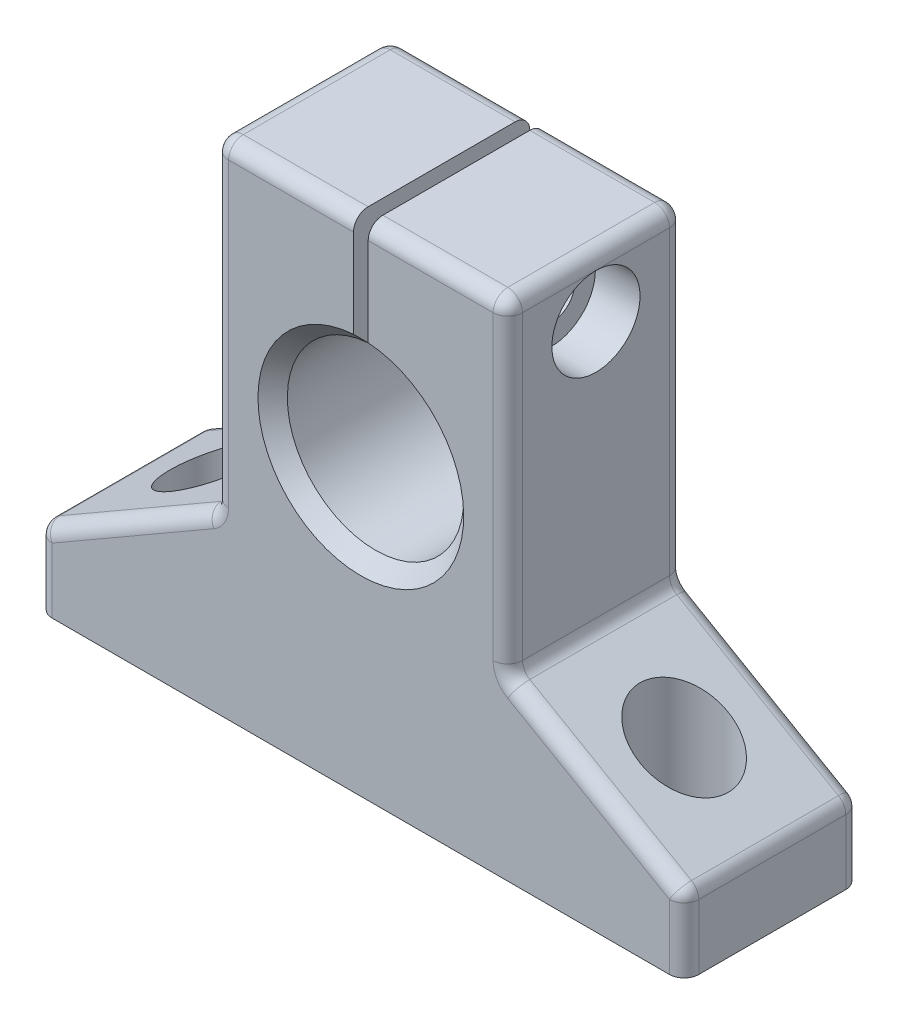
ISO-10303-21;
HEADER;
FILE_DESCRIPTION(('STEP AP214'),'2;1');
FILE_NAME('part.step','',(''),(''),'','','');
FILE_SCHEMA(('AUTOMOTIVE_DESIGN { 1 0 10303 214 1 1 1 1 }'));
ENDSEC;
DATA;
#1=APPLICATION_CONTEXT('core data for automotive mechanical design processes');
#2=APPLICATION_PROTOCOL_DEFINITION('international standard','automotive_design',2000,#1);
#3=PRODUCT_CONTEXT('',#1,'mechanical');
#4=PRODUCT('Part','Part','',(#3));
#5=PRODUCT_RELATED_PRODUCT_CATEGORY('part','',(#4));
#6=PRODUCT_DEFINITION_FORMATION('','',#4);
#7=PRODUCT_DEFINITION_CONTEXT('part definition',#1,'design');
#8=PRODUCT_DEFINITION('design','',#6,#7);
#9=PRODUCT_DEFINITION_SHAPE('','',#8);
#10=(LENGTH_UNIT() NAMED_UNIT(*) SI_UNIT(.MILLI.,.METRE.));
#11=(NAMED_UNIT(*) PLANE_ANGLE_UNIT() SI_UNIT($,.RADIAN.));
#12=(NAMED_UNIT(*) SI_UNIT($,.STERADIAN.) SOLID_ANGLE_UNIT());
#13=UNCERTAINTY_MEASURE_WITH_UNIT(LENGTH_MEASURE(1.E-05),#10,'distance_accuracy_value','');
#14=(GEOMETRIC_REPRESENTATION_CONTEXT(3) GLOBAL_UNCERTAINTY_ASSIGNED_CONTEXT((#13)) GLOBAL_UNIT_ASSIGNED_CONTEXT((#10,
#11,#12)) REPRESENTATION_CONTEXT('',''));
#15=CARTESIAN_POINT('',(0.,0.,0.));
#16=DIRECTION('',(0.,0.,1.));
#17=DIRECTION('',(1.,0.,0.));
#18=AXIS2_PLACEMENT_3D('',#15,#16,#17);
#19=CARTESIAN_POINT('',(34.925,0.,9.525));
#20=DIRECTION('',(-1.,0.,0.));
#21=DIRECTION('',(0.,0.,1.));
#22=AXIS2_PLACEMENT_3D('',#19,#20,#21);
#23=PLANE('',#22);
#24=DIRECTION('',(0.,0.,-1.));
#25=VECTOR('',#24,1.);
#26=CARTESIAN_POINT('',(34.925,7.02095644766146,9.525));
#27=LINE('',#26,#25);
#28=CARTESIAN_POINT('',(34.925,7.02095644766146,-7.9375));
#29=VERTEX_POINT('',#28);
#30=CARTESIAN_POINT('',(34.925,7.02095644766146,7.9375));
#31=VERTEX_POINT('',#30);
#32=EDGE_CURVE('E363',#29,#31,#27,.F.);
#33=ORIENTED_EDGE('',*,*,#32,.T.);
#34=DIRECTION('',(0.,1.,0.));
#35=VECTOR('',#34,1.);
#36=CARTESIAN_POINT('',(34.925,0.,7.9375));
#37=LINE('',#36,#35);
#38=CARTESIAN_POINT('',(34.925,0.,7.9375));
#39=VERTEX_POINT('',#38);
#40=EDGE_CURVE('E367',#31,#39,#37,.F.);
#41=ORIENTED_EDGE('',*,*,#40,.T.);
#42=DIRECTION('',(0.,0.,-1.));
#43=VECTOR('',#42,1.);
#44=CARTESIAN_POINT('',(34.925,0.,9.525));
#45=LINE('',#44,#43);
#46=CARTESIAN_POINT('',(34.925,0.,-7.93749999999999));
#47=VERTEX_POINT('',#46);
#48=EDGE_CURVE('E797',#39,#47,#45,.T.);
#49=ORIENTED_EDGE('',*,*,#48,.T.);
#50=DIRECTION('',(0.,1.,0.));
#51=VECTOR('',#50,1.);
#52=CARTESIAN_POINT('',(34.925,0.,-7.9375));
#53=LINE('',#52,#51);
#54=EDGE_CURVE('E365',#47,#29,#53,.T.);
#55=ORIENTED_EDGE('',*,*,#54,.T.);
#56=EDGE_LOOP('',(#33,#41,#49,#55));
#57=FACE_BOUND('',#56,.T.);
#58=ADVANCED_FACE('F34',(#57),#23,.F.);
#59=CARTESIAN_POINT('',(34.925,7.9375,9.525));
#60=DIRECTION('',(-0.499999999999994,-0.866025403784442,0.));
#61=DIRECTION('',(0.866025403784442,-0.499999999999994,0.));
#62=AXIS2_PLACEMENT_3D('',#59,#60,#61);
#63=PLANE('',#62);
#64=DIRECTION('',(-0.866025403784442,0.499999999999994,0.));
#65=VECTOR('',#64,1.);
#66=CARTESIAN_POINT('',(34.925,7.9375,7.9375));
#67=LINE('',#66,#65);
#68=CARTESIAN_POINT('',(16.66875,18.4777508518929,7.9375));
#69=VERTEX_POINT('',#68);
#70=CARTESIAN_POINT('',(34.13125,8.39577177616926,7.9375));
#71=VERTEX_POINT('',#70);
#72=EDGE_CURVE('E322',#69,#71,#67,.F.);
#73=ORIENTED_EDGE('',*,*,#72,.T.);
#74=DIRECTION('',(0.,0.,-1.));
#75=VECTOR('',#74,1.);
#76=CARTESIAN_POINT('',(34.13125,8.39577177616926,9.525));
#77=LINE('',#76,#75);
#78=CARTESIAN_POINT('',(34.13125,8.39577177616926,-7.9375));
#79=VERTEX_POINT('',#78);
#80=EDGE_CURVE('E327',#71,#79,#77,.T.);
#81=ORIENTED_EDGE('',*,*,#80,.T.);
#82=DIRECTION('',(-0.866025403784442,0.499999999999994,0.));
#83=VECTOR('',#82,1.);
#84=CARTESIAN_POINT('',(34.925,7.9375,-7.9375));
#85=LINE('',#84,#83);
#86=CARTESIAN_POINT('',(16.66875,18.4777508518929,-7.9375));
#87=VERTEX_POINT('',#86);
#88=EDGE_CURVE('E324',#79,#87,#85,.T.);
#89=ORIENTED_EDGE('',*,*,#88,.T.);
#90=DIRECTION('',(0.,0.,-1.));
#91=VECTOR('',#90,1.);
#92=CARTESIAN_POINT('',(16.66875,18.4777508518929,9.525));
#93=LINE('',#92,#91);
#94=EDGE_CURVE('E320',#87,#69,#93,.F.);
#95=ORIENTED_EDGE('',*,*,#94,.T.);
#96=EDGE_LOOP('',(#73,#81,#89,#95));
#97=FACE_BOUND('',#96,.T.);
#98=CARTESIAN_POINT('',(25.4,13.4367613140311,0.));
#99=DIRECTION('',(-0.499999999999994,-0.866025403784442,0.));
#100=DIRECTION('',(-0.866025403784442,0.499999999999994,0.));
#101=AXIS2_PLACEMENT_3D('',#98,#99,#100);
#102=ELLIPSE('',#101,5.49926131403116,4.7625);
#103=CARTESIAN_POINT('',(20.6375,16.1863919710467,0.));
#104=VERTEX_POINT('',#103);
#105=EDGE_CURVE('E766',#104,#104,#102,.T.);
#106=ORIENTED_EDGE('',*,*,#105,.T.);
#107=EDGE_LOOP('',(#106));
#108=FACE_BOUND('',#107,.T.);
#109=ADVANCED_FACE('F654',(#97,#108),#63,.F.);
#110=CARTESIAN_POINT('',(15.875,18.9360226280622,9.525));
#111=DIRECTION('',(-1.,0.,0.));
#112=DIRECTION('',(0.,0.,1.));
#113=AXIS2_PLACEMENT_3D('',#110,#111,#112);
#114=PLANE('',#113);
#115=DIRECTION('',(0.,1.,0.));
#116=VECTOR('',#115,1.);
#117=CARTESIAN_POINT('',(15.875,18.9360226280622,7.9375));
#118=LINE('',#117,#116);
#119=CARTESIAN_POINT('',(15.875,52.3875,7.9375));
#120=VERTEX_POINT('',#119);
#121=CARTESIAN_POINT('',(15.875,19.8525661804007,7.9375));
#122=VERTEX_POINT('',#121);
#123=EDGE_CURVE('E401',#120,#122,#118,.F.);
#124=ORIENTED_EDGE('',*,*,#123,.T.);
#125=DIRECTION('',(0.,0.,-1.));
#126=VECTOR('',#125,1.);
#127=CARTESIAN_POINT('',(15.875,19.8525661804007,-9.525));
#128=LINE('',#127,#126);
#129=CARTESIAN_POINT('',(15.875,19.8525661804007,-7.9375));
#130=VERTEX_POINT('',#129);
#131=EDGE_CURVE('E406',#122,#130,#128,.T.);
#132=ORIENTED_EDGE('',*,*,#131,.T.);
#133=DIRECTION('',(0.,1.,0.));
#134=VECTOR('',#133,1.);
#135=CARTESIAN_POINT('',(15.875,18.9360226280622,-7.9375));
#136=LINE('',#135,#134);
#137=CARTESIAN_POINT('',(15.875,52.3875,-7.9375));
#138=VERTEX_POINT('',#137);
#139=EDGE_CURVE('E403',#130,#138,#136,.T.);
#140=ORIENTED_EDGE('',*,*,#139,.T.);
#141=DIRECTION('',(0.,0.,-1.));
#142=VECTOR('',#141,1.);
#143=CARTESIAN_POINT('',(15.875,52.3875,9.525));
#144=LINE('',#143,#142);
#145=EDGE_CURVE('E399',#138,#120,#144,.F.);
#146=ORIENTED_EDGE('',*,*,#145,.T.);
#147=EDGE_LOOP('',(#124,#132,#140,#146));
#148=FACE_BOUND('',#147,.T.);
#149=CARTESIAN_POINT('',(15.875,47.6084347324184,0.));
#150=DIRECTION('',(1.,0.,0.));
#151=DIRECTION('',(0.,0.,-1.));
#152=AXIS2_PLACEMENT_3D('',#149,#150,#151);
#153=CIRCLE('',#152,4.7625);
#154=CARTESIAN_POINT('',(15.875,47.6084347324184,-4.7625));
#155=VERTEX_POINT('',#154);
#156=EDGE_CURVE('E773',#155,#155,#153,.T.);
#157=ORIENTED_EDGE('',*,*,#156,.F.);
#158=EDGE_LOOP('',(#157));
#159=FACE_BOUND('',#158,.T.);
#160=ADVANCED_FACE('F659',(#148,#159),#114,.F.);
#161=CARTESIAN_POINT('',(15.875,53.975,9.525));
#162=DIRECTION('',(0.,-1.,0.));
#163=DIRECTION('',(0.,0.,-1.));
#164=AXIS2_PLACEMENT_3D('',#161,#162,#163);
#165=PLANE('',#164);
#166=DIRECTION('',(0.,0.,-1.));
#167=VECTOR('',#166,1.);
#168=CARTESIAN_POINT('',(0.793750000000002,53.975,9.525));
#169=LINE('',#168,#167);
#170=CARTESIAN_POINT('',(0.793750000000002,53.975,7.9375));
#171=VERTEX_POINT('',#170);
#172=CARTESIAN_POINT('',(0.793750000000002,53.975,-7.93749999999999));
#173=VERTEX_POINT('',#172);
#174=EDGE_CURVE('E284',#171,#173,#169,.T.);
#175=ORIENTED_EDGE('',*,*,#174,.F.);
#176=DIRECTION('',(-1.,0.,0.));
#177=VECTOR('',#176,1.);
#178=CARTESIAN_POINT('',(15.875,53.975,7.9375));
#179=LINE('',#178,#177);
#180=CARTESIAN_POINT('',(14.2875,53.975,7.9375));
#181=VERTEX_POINT('',#180);
#182=EDGE_CURVE('E377',#171,#181,#179,.F.);
#183=ORIENTED_EDGE('',*,*,#182,.T.);
#184=DIRECTION('',(0.,0.,-1.));
#185=VECTOR('',#184,1.);
#186=CARTESIAN_POINT('',(14.2875,53.975,9.525));
#187=LINE('',#186,#185);
#188=CARTESIAN_POINT('',(14.2875,53.975,-7.9375));
#189=VERTEX_POINT('',#188);
#190=EDGE_CURVE('E373',#181,#189,#187,.T.);
#191=ORIENTED_EDGE('',*,*,#190,.T.);
#192=DIRECTION('',(-1.,0.,0.));
#193=VECTOR('',#192,1.);
#194=CARTESIAN_POINT('',(15.875,53.975,-7.9375));
#195=LINE('',#194,#193);
#196=EDGE_CURVE('E375',#189,#173,#195,.T.);
#197=ORIENTED_EDGE('',*,*,#196,.T.);
#198=EDGE_LOOP('',(#175,#183,#191,#197));
#199=FACE_BOUND('',#198,.T.);
#200=ADVANCED_FACE('F445',(#199),#165,.F.);
#201=CARTESIAN_POINT('',(0.793750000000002,53.975,9.525));
#202=DIRECTION('',(1.,0.,0.));
#203=DIRECTION('',(0.,1.,0.));
#204=AXIS2_PLACEMENT_3D('',#201,#202,#203);
#205=PLANE('',#204);
#206=CARTESIAN_POINT('',(0.793750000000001,47.6084347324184,0.));
#207=DIRECTION('',(1.,0.,0.));
#208=DIRECTION('',(0.,1.,0.));
#209=AXIS2_PLACEMENT_3D('',#206,#207,#208);
#210=CIRCLE('',#209,2.55269999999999);
#211=CARTESIAN_POINT('',(0.793750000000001,50.1611347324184,0.));
#212=VERTEX_POINT('',#211);
#213=EDGE_CURVE('E780',#212,#212,#210,.T.);
#214=ORIENTED_EDGE('',*,*,#213,.T.);
#215=EDGE_LOOP('',(#214));
#216=FACE_BOUND('',#215,.T.);
#217=DIRECTION('',(0.,-1.,0.));
#218=VECTOR('',#217,1.);
#219=CARTESIAN_POINT('',(0.793750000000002,53.975,-9.525));
#220=LINE('',#219,#218);
#221=CARTESIAN_POINT('',(0.793750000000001,52.3875,-9.525));
#222=VERTEX_POINT('',#221);
#223=CARTESIAN_POINT('',(0.79375,42.8341155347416,-9.525));
#224=VERTEX_POINT('',#223);
#225=EDGE_CURVE('E783',#222,#224,#220,.T.);
#226=ORIENTED_EDGE('',*,*,#225,.T.);
#227=CARTESIAN_POINT('',(0.79375,42.8341155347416,-9.525));
#228=CARTESIAN_POINT('',(0.79375,42.568802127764,-9.26035554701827));
#229=CARTESIAN_POINT('',(0.79375,42.3034582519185,-8.99574165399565));
#230=CARTESIAN_POINT('',(0.79375,41.7727095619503,-8.46657498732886));
#231=CARTESIAN_POINT('',(0.79375,41.5073047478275,-8.2020222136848));
#232=CARTESIAN_POINT('',(0.79375,41.2418694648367,-7.93749999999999));
#233=B_SPLINE_CURVE_WITH_KNOTS('',3,(#227,#228,#229,#230,#231,#232),.UNSPECIFIED.,.F.,.F.,(4,2,
4),(0.,1.1242112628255,2.24842252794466),.UNSPECIFIED.);
#234=CARTESIAN_POINT('',(0.793750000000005,41.2418694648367,-7.93749999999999));
#235=VERTEX_POINT('',#234);
#236=EDGE_CURVE('E41',#224,#235,#233,.T.);
#237=ORIENTED_EDGE('',*,*,#236,.T.);
#238=DIRECTION('',(0.,0.,-1.));
#239=VECTOR('',#238,1.);
#240=CARTESIAN_POINT('',(0.793750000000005,41.2418694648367,9.525));
#241=LINE('',#240,#239);
#242=CARTESIAN_POINT('',(0.793750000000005,41.2418694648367,7.93749999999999));
#243=VERTEX_POINT('',#242);
#244=EDGE_CURVE('E287',#243,#235,#241,.T.);
#245=ORIENTED_EDGE('',*,*,#244,.F.);
#246=CARTESIAN_POINT('',(0.793750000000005,41.2418694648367,7.93749999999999));
#247=CARTESIAN_POINT('',(0.793750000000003,41.5073047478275,8.2020222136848));
#248=CARTESIAN_POINT('',(0.793750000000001,41.7727095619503,8.46657498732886));
#249=CARTESIAN_POINT('',(0.793749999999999,42.3034582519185,8.99574165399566));
#250=CARTESIAN_POINT('',(0.793749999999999,42.568802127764,9.26035554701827));
#251=CARTESIAN_POINT('',(0.79375,42.8341155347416,9.525));
#252=B_SPLINE_CURVE_WITH_KNOTS('',3,(#246,#247,#248,#249,#250,#251),.UNSPECIFIED.,.F.,.F.,(4,2,
4),(0.,1.12421126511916,2.24842252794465),.UNSPECIFIED.);
#253=CARTESIAN_POINT('',(0.79375,42.8341155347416,9.525));
#254=VERTEX_POINT('',#253);
#255=EDGE_CURVE('E48',#243,#254,#252,.T.);
#256=ORIENTED_EDGE('',*,*,#255,.T.);
#257=DIRECTION('',(0.,-1.,0.));
#258=VECTOR('',#257,1.);
#259=CARTESIAN_POINT('',(0.793750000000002,53.975,9.525));
#260=LINE('',#259,#258);
#261=CARTESIAN_POINT('',(0.793750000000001,52.3875,9.525));
#262=VERTEX_POINT('',#261);
#263=EDGE_CURVE('E790',#262,#254,#260,.T.);
#264=ORIENTED_EDGE('',*,*,#263,.F.);
#265=CARTESIAN_POINT('',(0.793750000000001,52.3875,7.9375));
#266=DIRECTION('',(1.,0.,0.));
#267=DIRECTION('',(0.,1.,0.));
#268=AXIS2_PLACEMENT_3D('',#265,#266,#267);
#269=CIRCLE('',#268,1.5875);
#270=EDGE_CURVE('E371',#262,#171,#269,.F.);
#271=ORIENTED_EDGE('',*,*,#270,.T.);
#272=ORIENTED_EDGE('',*,*,#174,.T.);
#273=CARTESIAN_POINT('',(0.793750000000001,52.3875,-7.9375));
#274=DIRECTION('',(1.,0.,0.));
#275=DIRECTION('',(0.,1.,0.));
#276=AXIS2_PLACEMENT_3D('',#273,#274,#275);
#277=CIRCLE('',#276,1.5875);
#278=EDGE_CURVE('E369',#173,#222,#277,.F.);
#279=ORIENTED_EDGE('',*,*,#278,.T.);
#280=EDGE_LOOP('',(#226,#237,#245,#256,#264,#271,#272,#279));
#281=FACE_BOUND('',#280,.T.);
#282=ADVANCED_FACE('F440',(#216,#281),#205,.F.);
#283=CARTESIAN_POINT('',(0.,31.75,9.525));
#284=DIRECTION('',(0.,0.,-1.));
#285=DIRECTION('',(-1.,0.,0.));
#286=AXIS2_PLACEMENT_3D('',#283,#284,#285);
#287=CYLINDRICAL_SURFACE('',#286,9.525);
#288=ORIENTED_EDGE('',*,*,#244,.T.);
#289=CARTESIAN_POINT('',(0.,31.75,-7.93749999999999));
#290=DIRECTION('',(0.,0.,1.));
#291=DIRECTION('',(1.,0.,0.));
#292=AXIS2_PLACEMENT_3D('',#289,#290,#291);
#293=CIRCLE('',#292,9.525);
#294=CARTESIAN_POINT('',(-0.79375,41.2418694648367,-7.93749999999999));
#295=VERTEX_POINT('',#294);
#296=EDGE_CURVE('E410',#235,#295,#293,.F.);
#297=ORIENTED_EDGE('',*,*,#296,.T.);
#298=DIRECTION('',(0.,0.,-1.));
#299=VECTOR('',#298,1.);
#300=CARTESIAN_POINT('',(-0.79375,41.2418694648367,9.525));
#301=LINE('',#300,#299);
#302=CARTESIAN_POINT('',(-0.79375,41.2418694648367,7.93749999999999));
#303=VERTEX_POINT('',#302);
#304=EDGE_CURVE('E805',#303,#295,#301,.T.);
#305=ORIENTED_EDGE('',*,*,#304,.F.);
#306=CARTESIAN_POINT('',(0.,31.75,7.93749999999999));
#307=DIRECTION('',(0.,0.,1.));
#308=DIRECTION('',(1.,0.,0.));
#309=AXIS2_PLACEMENT_3D('',#306,#307,#308);
#310=CIRCLE('',#309,9.525);
#311=EDGE_CURVE('E408',#303,#243,#310,.T.);
#312=ORIENTED_EDGE('',*,*,#311,.T.);
#313=EDGE_LOOP('',(#288,#297,#305,#312));
#314=FACE_BOUND('',#313,.T.);
#315=ADVANCED_FACE('F434',(#314),#287,.F.);
#316=CARTESIAN_POINT('',(-0.793750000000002,53.975,9.525));
#317=DIRECTION('',(-1.,0.,0.));
#318=DIRECTION('',(0.,-1.,0.));
#319=AXIS2_PLACEMENT_3D('',#316,#317,#318);
#320=PLANE('',#319);
#321=CARTESIAN_POINT('',(-0.793750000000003,47.6084347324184,0.));
#322=DIRECTION('',(-1.,0.,0.));
#323=DIRECTION('',(0.,-1.,0.));
#324=AXIS2_PLACEMENT_3D('',#321,#322,#323);
#325=CIRCLE('',#324,2.55269999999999);
#326=CARTESIAN_POINT('',(-0.793750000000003,47.6084347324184,-2.55269999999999));
#327=VERTEX_POINT('',#326);
#328=EDGE_CURVE('E777',#327,#327,#325,.T.);
#329=ORIENTED_EDGE('',*,*,#328,.T.);
#330=EDGE_LOOP('',(#329));
#331=FACE_BOUND('',#330,.T.);
#332=ORIENTED_EDGE('',*,*,#304,.T.);
#333=CARTESIAN_POINT('',(-0.79375,41.2418694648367,-7.93749999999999));
#334=CARTESIAN_POINT('',(-0.79375,41.5073047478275,-8.2020222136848));
#335=CARTESIAN_POINT('',(-0.79375,41.7727095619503,-8.46657498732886));
#336=CARTESIAN_POINT('',(-0.79375,42.3034582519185,-8.99574165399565));
#337=CARTESIAN_POINT('',(-0.79375,42.568802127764,-9.26035554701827));
#338=CARTESIAN_POINT('',(-0.79375,42.8341155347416,-9.525));
#339=B_SPLINE_CURVE_WITH_KNOTS('',3,(#333,#334,#335,#336,#337,#338),.UNSPECIFIED.,.F.,.F.,(4,2,
4),(0.,1.12421126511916,2.24842252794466),.UNSPECIFIED.);
#340=CARTESIAN_POINT('',(-0.79375,42.8341155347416,-9.525));
#341=VERTEX_POINT('',#340);
#342=EDGE_CURVE('E420',#295,#341,#339,.T.);
#343=ORIENTED_EDGE('',*,*,#342,.T.);
#344=DIRECTION('',(0.,1.,0.));
#345=VECTOR('',#344,1.);
#346=CARTESIAN_POINT('',(-0.793750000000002,53.975,-9.525));
#347=LINE('',#346,#345);
#348=CARTESIAN_POINT('',(-0.793750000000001,52.3875,-9.525));
#349=VERTEX_POINT('',#348);
#350=EDGE_CURVE('E785',#341,#349,#347,.T.);
#351=ORIENTED_EDGE('',*,*,#350,.T.);
#352=CARTESIAN_POINT('',(-0.793750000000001,52.3875,-7.9375));
#353=DIRECTION('',(-1.,0.,0.));
#354=DIRECTION('',(0.,-1.,0.));
#355=AXIS2_PLACEMENT_3D('',#352,#353,#354);
#356=CIRCLE('',#355,1.5875);
#357=CARTESIAN_POINT('',(-0.793750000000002,53.975,-7.93749999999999));
#358=VERTEX_POINT('',#357);
#359=EDGE_CURVE('E385',#349,#358,#356,.F.);
#360=ORIENTED_EDGE('',*,*,#359,.T.);
#361=DIRECTION('',(0.,0.,-1.));
#362=VECTOR('',#361,1.);
#363=CARTESIAN_POINT('',(-0.793750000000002,53.975,9.525));
#364=LINE('',#363,#362);
#365=CARTESIAN_POINT('',(-0.793750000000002,53.975,7.9375));
#366=VERTEX_POINT('',#365);
#367=EDGE_CURVE('E802',#366,#358,#364,.T.);
#368=ORIENTED_EDGE('',*,*,#367,.F.);
#369=CARTESIAN_POINT('',(-0.793750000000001,52.3875,7.9375));
#370=DIRECTION('',(-1.,0.,0.));
#371=DIRECTION('',(0.,-1.,0.));
#372=AXIS2_PLACEMENT_3D('',#369,#370,#371);
#373=CIRCLE('',#372,1.5875);
#374=CARTESIAN_POINT('',(-0.793750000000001,52.3875,9.525));
#375=VERTEX_POINT('',#374);
#376=EDGE_CURVE('E387',#366,#375,#373,.F.);
#377=ORIENTED_EDGE('',*,*,#376,.T.);
#378=DIRECTION('',(0.,1.,0.));
#379=VECTOR('',#378,1.);
#380=CARTESIAN_POINT('',(-0.793750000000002,53.975,9.525));
#381=LINE('',#380,#379);
#382=CARTESIAN_POINT('',(-0.79375,42.8341155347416,9.525));
#383=VERTEX_POINT('',#382);
#384=EDGE_CURVE('E792',#383,#375,#381,.T.);
#385=ORIENTED_EDGE('',*,*,#384,.F.);
#386=CARTESIAN_POINT('',(-0.79375,42.8341155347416,9.525));
#387=CARTESIAN_POINT('',(-0.79375,42.568802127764,9.26035554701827));
#388=CARTESIAN_POINT('',(-0.79375,42.3034582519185,8.99574165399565));
#389=CARTESIAN_POINT('',(-0.79375,41.7727095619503,8.46657498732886));
#390=CARTESIAN_POINT('',(-0.79375,41.5073047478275,8.2020222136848));
#391=CARTESIAN_POINT('',(-0.79375,41.2418694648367,7.93749999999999));
#392=B_SPLINE_CURVE_WITH_KNOTS('',3,(#386,#387,#388,#389,#390,#391),.UNSPECIFIED.,.F.,.F.,(4,2,
4),(0.,1.12421126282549,2.24842252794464),.UNSPECIFIED.);
#393=EDGE_CURVE('E413',#383,#303,#392,.T.);
#394=ORIENTED_EDGE('',*,*,#393,.T.);
#395=EDGE_LOOP('',(#332,#343,#351,#360,#368,#377,#385,#394));
#396=FACE_BOUND('',#395,.T.);
#397=ADVANCED_FACE('F428',(#331,#396),#320,.F.);
#398=CARTESIAN_POINT('',(-0.793750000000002,53.975,9.525));
#399=DIRECTION('',(0.,-1.,0.));
#400=DIRECTION('',(0.,0.,-1.));
#401=AXIS2_PLACEMENT_3D('',#398,#399,#400);
#402=PLANE('',#401);
#403=DIRECTION('',(0.,0.,-1.));
#404=VECTOR('',#403,1.);
#405=CARTESIAN_POINT('',(-14.2875,53.975,9.525));
#406=LINE('',#405,#404);
#407=CARTESIAN_POINT('',(-14.2875,53.975,-7.9375));
#408=VERTEX_POINT('',#407);
#409=CARTESIAN_POINT('',(-14.2875,53.975,7.9375));
#410=VERTEX_POINT('',#409);
#411=EDGE_CURVE('E379',#408,#410,#406,.F.);
#412=ORIENTED_EDGE('',*,*,#411,.T.);
#413=DIRECTION('',(-1.,0.,0.));
#414=VECTOR('',#413,1.);
#415=CARTESIAN_POINT('',(-0.793750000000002,53.975,7.9375));
#416=LINE('',#415,#414);
#417=EDGE_CURVE('E383',#410,#366,#416,.F.);
#418=ORIENTED_EDGE('',*,*,#417,.T.);
#419=ORIENTED_EDGE('',*,*,#367,.T.);
#420=DIRECTION('',(-1.,0.,0.));
#421=VECTOR('',#420,1.);
#422=CARTESIAN_POINT('',(-0.793750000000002,53.975,-7.9375));
#423=LINE('',#422,#421);
#424=EDGE_CURVE('E381',#358,#408,#423,.T.);
#425=ORIENTED_EDGE('',*,*,#424,.T.);
#426=EDGE_LOOP('',(#412,#418,#419,#425));
#427=FACE_BOUND('',#426,.T.);
#428=ADVANCED_FACE('F433',(#427),#402,.F.);
#429=CARTESIAN_POINT('',(-15.875,18.9360226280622,9.525));
#430=DIRECTION('',(1.,0.,0.));
#431=DIRECTION('',(0.,0.,-1.));
#432=AXIS2_PLACEMENT_3D('',#429,#430,#431);
#433=PLANE('',#432);
#434=DIRECTION('',(0.,-1.,0.));
#435=VECTOR('',#434,1.);
#436=CARTESIAN_POINT('',(-15.875,18.9360226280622,-7.9375));
#437=LINE('',#436,#435);
#438=CARTESIAN_POINT('',(-15.875,52.3875,-7.9375));
#439=VERTEX_POINT('',#438);
#440=CARTESIAN_POINT('',(-15.875,19.8525661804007,-7.9375));
#441=VERTEX_POINT('',#440);
#442=EDGE_CURVE('E394',#439,#441,#437,.T.);
#443=ORIENTED_EDGE('',*,*,#442,.T.);
#444=DIRECTION('',(0.,0.,-1.));
#445=VECTOR('',#444,1.);
#446=CARTESIAN_POINT('',(-15.875,19.8525661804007,9.525));
#447=LINE('',#446,#445);
#448=CARTESIAN_POINT('',(-15.875,19.8525661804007,7.9375));
#449=VERTEX_POINT('',#448);
#450=EDGE_CURVE('E397',#441,#449,#447,.F.);
#451=ORIENTED_EDGE('',*,*,#450,.T.);
#452=DIRECTION('',(0.,-1.,0.));
#453=VECTOR('',#452,1.);
#454=CARTESIAN_POINT('',(-15.875,53.975,7.9375));
#455=LINE('',#454,#453);
#456=CARTESIAN_POINT('',(-15.875,52.3875,7.9375));
#457=VERTEX_POINT('',#456);
#458=EDGE_CURVE('E392',#449,#457,#455,.F.);
#459=ORIENTED_EDGE('',*,*,#458,.T.);
#460=DIRECTION('',(0.,0.,-1.));
#461=VECTOR('',#460,1.);
#462=CARTESIAN_POINT('',(-15.875,52.3875,9.525));
#463=LINE('',#462,#461);
#464=EDGE_CURVE('E390',#457,#439,#463,.T.);
#465=ORIENTED_EDGE('',*,*,#464,.T.);
#466=EDGE_LOOP('',(#443,#451,#459,#465));
#467=FACE_BOUND('',#466,.T.);
#468=CARTESIAN_POINT('',(-15.875,47.6084347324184,0.));
#469=DIRECTION('',(1.,0.,0.));
#470=DIRECTION('',(0.,0.,-1.));
#471=AXIS2_PLACEMENT_3D('',#468,#469,#470);
#472=CIRCLE('',#471,2.55269999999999);
#473=CARTESIAN_POINT('',(-15.875,47.6084347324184,-2.55269999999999));
#474=VERTEX_POINT('',#473);
#475=EDGE_CURVE('E776',#474,#474,#472,.T.);
#476=ORIENTED_EDGE('',*,*,#475,.T.);
#477=EDGE_LOOP('',(#476));
#478=FACE_BOUND('',#477,.T.);
#479=ADVANCED_FACE('F645',(#467,#478),#433,.F.);
#480=CARTESIAN_POINT('',(-34.925,7.9375,9.525));
#481=DIRECTION('',(0.499999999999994,-0.866025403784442,0.));
#482=DIRECTION('',(0.866025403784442,0.499999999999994,0.));
#483=AXIS2_PLACEMENT_3D('',#480,#481,#482);
#484=PLANE('',#483);
#485=DIRECTION('',(-0.866025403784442,-0.499999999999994,0.));
#486=VECTOR('',#485,1.);
#487=CARTESIAN_POINT('',(-34.925,7.9375,-7.9375));
#488=LINE('',#487,#486);
#489=CARTESIAN_POINT('',(-16.66875,18.4777508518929,-7.9375));
#490=VERTEX_POINT('',#489);
#491=CARTESIAN_POINT('',(-34.13125,8.39577177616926,-7.9375));
#492=VERTEX_POINT('',#491);
#493=EDGE_CURVE('E258',#490,#492,#488,.T.);
#494=ORIENTED_EDGE('',*,*,#493,.T.);
#495=DIRECTION('',(0.,0.,-1.));
#496=VECTOR('',#495,1.);
#497=CARTESIAN_POINT('',(-34.13125,8.39577177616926,9.525));
#498=LINE('',#497,#496);
#499=CARTESIAN_POINT('',(-34.13125,8.39577177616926,7.9375));
#500=VERTEX_POINT('',#499);
#501=EDGE_CURVE('E254',#492,#500,#498,.F.);
#502=ORIENTED_EDGE('',*,*,#501,.T.);
#503=DIRECTION('',(-0.866025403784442,-0.499999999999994,0.));
#504=VECTOR('',#503,1.);
#505=CARTESIAN_POINT('',(-15.875,18.9360226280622,7.9375));
#506=LINE('',#505,#504);
#507=CARTESIAN_POINT('',(-16.66875,18.4777508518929,7.9375));
#508=VERTEX_POINT('',#507);
#509=EDGE_CURVE('E245',#500,#508,#506,.F.);
#510=ORIENTED_EDGE('',*,*,#509,.T.);
#511=DIRECTION('',(0.,0.,-1.));
#512=VECTOR('',#511,1.);
#513=CARTESIAN_POINT('',(-16.66875,18.4777508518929,-9.525));
#514=LINE('',#513,#512);
#515=EDGE_CURVE('E251',#508,#490,#514,.T.);
#516=ORIENTED_EDGE('',*,*,#515,.T.);
#517=EDGE_LOOP('',(#494,#502,#510,#516));
#518=FACE_BOUND('',#517,.T.);
#519=CARTESIAN_POINT('',(-25.4,13.4367613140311,0.));
#520=DIRECTION('',(0.499999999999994,-0.866025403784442,0.));
#521=DIRECTION('',(0.866025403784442,0.499999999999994,0.));
#522=AXIS2_PLACEMENT_3D('',#519,#520,#521);
#523=ELLIPSE('',#522,5.49926131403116,4.7625);
#524=CARTESIAN_POINT('',(-20.6375,16.1863919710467,0.));
#525=VERTEX_POINT('',#524);
#526=EDGE_CURVE('E290',#525,#525,#523,.T.);
#527=ORIENTED_EDGE('',*,*,#526,.T.);
#528=EDGE_LOOP('',(#527));
#529=FACE_BOUND('',#528,.T.);
#530=ADVANCED_FACE('F248',(#518,#529),#484,.F.);
#531=CARTESIAN_POINT('',(-34.925,0.,9.525));
#532=DIRECTION('',(1.,0.,0.));
#533=DIRECTION('',(0.,0.,-1.));
#534=AXIS2_PLACEMENT_3D('',#531,#532,#533);
#535=PLANE('',#534);
#536=DIRECTION('',(0.,0.,-1.));
#537=VECTOR('',#536,1.);
#538=CARTESIAN_POINT('',(-34.925,0.,9.525));
#539=LINE('',#538,#537);
#540=CARTESIAN_POINT('',(-34.925,0.,7.9375));
#541=VERTEX_POINT('',#540);
#542=CARTESIAN_POINT('',(-34.925,0.,-7.93749999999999));
#543=VERTEX_POINT('',#542);
#544=EDGE_CURVE('E799',#541,#543,#539,.T.);
#545=ORIENTED_EDGE('',*,*,#544,.F.);
#546=DIRECTION('',(0.,-1.,0.));
#547=VECTOR('',#546,1.);
#548=CARTESIAN_POINT('',(-34.925,7.9375,7.9375));
#549=LINE('',#548,#547);
#550=CARTESIAN_POINT('',(-34.925,7.02095644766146,7.9375));
#551=VERTEX_POINT('',#550);
#552=EDGE_CURVE('E361',#541,#551,#549,.F.);
#553=ORIENTED_EDGE('',*,*,#552,.T.);
#554=DIRECTION('',(0.,0.,-1.));
#555=VECTOR('',#554,1.);
#556=CARTESIAN_POINT('',(-34.925,7.02095644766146,9.525));
#557=LINE('',#556,#555);
#558=CARTESIAN_POINT('',(-34.925,7.02095644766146,-7.9375));
#559=VERTEX_POINT('',#558);
#560=EDGE_CURVE('E357',#551,#559,#557,.T.);
#561=ORIENTED_EDGE('',*,*,#560,.T.);
#562=DIRECTION('',(0.,-1.,0.));
#563=VECTOR('',#562,1.);
#564=CARTESIAN_POINT('',(-34.925,0.,-7.9375));
#565=LINE('',#564,#563);
#566=EDGE_CURVE('E359',#559,#543,#565,.T.);
#567=ORIENTED_EDGE('',*,*,#566,.T.);
#568=EDGE_LOOP('',(#545,#553,#561,#567));
#569=FACE_BOUND('',#568,.T.);
#570=ADVANCED_FACE('F639',(#569),#535,.F.);
#571=CARTESIAN_POINT('',(-34.925,0.,9.525));
#572=DIRECTION('',(0.,1.,0.));
#573=DIRECTION('',(0.,0.,1.));
#574=AXIS2_PLACEMENT_3D('',#571,#572,#573);
#575=PLANE('',#574);
#576=CARTESIAN_POINT('',(-25.4,0.,0.));
#577=DIRECTION('',(0.,1.,0.));
#578=DIRECTION('',(0.,0.,1.));
#579=AXIS2_PLACEMENT_3D('',#576,#577,#578);
#580=CIRCLE('',#579,2.5527);
#581=CARTESIAN_POINT('',(-25.4,0.,2.5527));
#582=VERTEX_POINT('',#581);
#583=EDGE_CURVE('E748',#582,#582,#580,.T.);
#584=ORIENTED_EDGE('',*,*,#583,.T.);
#585=EDGE_LOOP('',(#584));
#586=FACE_BOUND('',#585,.T.);
#587=CARTESIAN_POINT('',(25.4,0.,0.));
#588=DIRECTION('',(0.,1.,0.));
#589=DIRECTION('',(0.,0.,1.));
#590=AXIS2_PLACEMENT_3D('',#587,#588,#589);
#591=CIRCLE('',#590,2.5527);
#592=CARTESIAN_POINT('',(25.4,0.,2.5527));
#593=VERTEX_POINT('',#592);
#594=EDGE_CURVE('E757',#593,#593,#591,.T.);
#595=ORIENTED_EDGE('',*,*,#594,.T.);
#596=EDGE_LOOP('',(#595));
#597=FACE_BOUND('',#596,.T.);
#598=DIRECTION('',(1.,0.,0.));
#599=VECTOR('',#598,1.);
#600=CARTESIAN_POINT('',(-34.925,0.,9.525));
#601=LINE('',#600,#599);
#602=CARTESIAN_POINT('',(-33.3375,0.,9.525));
#603=VERTEX_POINT('',#602);
#604=CARTESIAN_POINT('',(33.3375,0.,9.525));
#605=VERTEX_POINT('',#604);
#606=EDGE_CURVE('E794',#603,#605,#601,.T.);
#607=ORIENTED_EDGE('',*,*,#606,.F.);
#608=CARTESIAN_POINT('',(-33.3375,0.,7.9375));
#609=DIRECTION('',(0.,1.,0.));
#610=DIRECTION('',(0.,0.,1.));
#611=AXIS2_PLACEMENT_3D('',#608,#609,#610);
#612=CIRCLE('',#611,1.5875);
#613=EDGE_CURVE('E355',#603,#541,#612,.F.);
#614=ORIENTED_EDGE('',*,*,#613,.T.);
#615=ORIENTED_EDGE('',*,*,#544,.T.);
#616=CARTESIAN_POINT('',(-33.3375,0.,-7.9375));
#617=DIRECTION('',(0.,1.,0.));
#618=DIRECTION('',(0.,0.,1.));
#619=AXIS2_PLACEMENT_3D('',#616,#617,#618);
#620=CIRCLE('',#619,1.5875);
#621=CARTESIAN_POINT('',(-33.3375,0.,-9.525));
#622=VERTEX_POINT('',#621);
#623=EDGE_CURVE('E353',#543,#622,#620,.F.);
#624=ORIENTED_EDGE('',*,*,#623,.T.);
#625=DIRECTION('',(1.,0.,0.));
#626=VECTOR('',#625,1.);
#627=CARTESIAN_POINT('',(-34.925,0.,-9.525));
#628=LINE('',#627,#626);
#629=CARTESIAN_POINT('',(33.3375,0.,-9.525));
#630=VERTEX_POINT('',#629);
#631=EDGE_CURVE('E787',#622,#630,#628,.T.);
#632=ORIENTED_EDGE('',*,*,#631,.T.);
#633=CARTESIAN_POINT('',(33.3375,0.,-7.9375));
#634=DIRECTION('',(0.,1.,0.));
#635=DIRECTION('',(0.,0.,1.));
#636=AXIS2_PLACEMENT_3D('',#633,#634,#635);
#637=CIRCLE('',#636,1.5875);
#638=EDGE_CURVE('E349',#630,#47,#637,.F.);
#639=ORIENTED_EDGE('',*,*,#638,.T.);
#640=ORIENTED_EDGE('',*,*,#48,.F.);
#641=CARTESIAN_POINT('',(33.3375,0.,7.9375));
#642=DIRECTION('',(0.,1.,0.));
#643=DIRECTION('',(0.,0.,1.));
#644=AXIS2_PLACEMENT_3D('',#641,#642,#643);
#645=CIRCLE('',#644,1.5875);
#646=EDGE_CURVE('E351',#39,#605,#645,.F.);
#647=ORIENTED_EDGE('',*,*,#646,.T.);
#648=EDGE_LOOP('',(#607,#614,#615,#624,#632,#639,#640,#647));
#649=FACE_BOUND('',#648,.T.);
#650=ADVANCED_FACE('F635',(#586,#597,#649),#575,.F.);
#651=CARTESIAN_POINT('',(0.,31.75,9.525));
#652=DIRECTION('',(0.,0.,1.));
#653=DIRECTION('',(1.,0.,0.));
#654=AXIS2_PLACEMENT_3D('',#651,#652,#653);
#655=PLANE('',#654);
#656=ORIENTED_EDGE('',*,*,#263,.T.);
#657=CARTESIAN_POINT('',(0.,31.75,9.525));
#658=DIRECTION('',(0.,0.,1.));
#659=DIRECTION('',(1.,0.,0.));
#660=AXIS2_PLACEMENT_3D('',#657,#658,#659);
#661=CIRCLE('',#660,11.1125);
#662=EDGE_CURVE('E11',#254,#383,#661,.F.);
#663=ORIENTED_EDGE('',*,*,#662,.T.);
#664=ORIENTED_EDGE('',*,*,#384,.T.);
#665=DIRECTION('',(-1.,0.,0.));
#666=VECTOR('',#665,1.);
#667=CARTESIAN_POINT('',(-15.875,52.3875,9.525));
#668=LINE('',#667,#666);
#669=CARTESIAN_POINT('',(-14.2875,52.3875,9.525));
#670=VERTEX_POINT('',#669);
#671=EDGE_CURVE('E333',#375,#670,#668,.T.);
#672=ORIENTED_EDGE('',*,*,#671,.T.);
#673=DIRECTION('',(0.,-1.,0.));
#674=VECTOR('',#673,1.);
#675=CARTESIAN_POINT('',(-14.2875,18.9360226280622,9.525));
#676=LINE('',#675,#674);
#677=CARTESIAN_POINT('',(-14.2875,19.8525661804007,9.525));
#678=VERTEX_POINT('',#677);
#679=EDGE_CURVE('E331',#670,#678,#676,.T.);
#680=ORIENTED_EDGE('',*,*,#679,.T.);
#681=CARTESIAN_POINT('',(-17.4625,19.8525661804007,9.525));
#682=DIRECTION('',(0.,0.,1.));
#683=DIRECTION('',(1.,0.,0.));
#684=AXIS2_PLACEMENT_3D('',#681,#682,#683);
#685=CIRCLE('',#684,3.175);
#686=CARTESIAN_POINT('',(-15.875,17.1029355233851,9.525));
#687=VERTEX_POINT('',#686);
#688=EDGE_CURVE('E329',#687,#678,#685,.T.);
#689=ORIENTED_EDGE('',*,*,#688,.F.);
#690=DIRECTION('',(-0.866025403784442,-0.499999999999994,0.));
#691=VECTOR('',#690,1.);
#692=CARTESIAN_POINT('',(-34.13125,6.5626846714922,9.525));
#693=LINE('',#692,#691);
#694=CARTESIAN_POINT('',(-33.3375,7.02095644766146,9.525));
#695=VERTEX_POINT('',#694);
#696=EDGE_CURVE('E265',#687,#695,#693,.T.);
#697=ORIENTED_EDGE('',*,*,#696,.T.);
#698=DIRECTION('',(0.,-1.,0.));
#699=VECTOR('',#698,1.);
#700=CARTESIAN_POINT('',(-33.3375,0.,9.525));
#701=LINE('',#700,#699);
#702=EDGE_CURVE('E336',#695,#603,#701,.T.);
#703=ORIENTED_EDGE('',*,*,#702,.T.);
#704=ORIENTED_EDGE('',*,*,#606,.T.);
#705=DIRECTION('',(0.,1.,0.));
#706=VECTOR('',#705,1.);
#707=CARTESIAN_POINT('',(33.3375,7.9375,9.525));
#708=LINE('',#707,#706);
#709=CARTESIAN_POINT('',(33.3375,7.02095644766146,9.525));
#710=VERTEX_POINT('',#709);
#711=EDGE_CURVE('E347',#605,#710,#708,.T.);
#712=ORIENTED_EDGE('',*,*,#711,.T.);
#713=DIRECTION('',(-0.866025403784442,0.499999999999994,0.));
#714=VECTOR('',#713,1.);
#715=CARTESIAN_POINT('',(15.08125,17.5612072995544,9.525));
#716=LINE('',#715,#714);
#717=CARTESIAN_POINT('',(15.875,17.1029355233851,9.525));
#718=VERTEX_POINT('',#717);
#719=EDGE_CURVE('E345',#710,#718,#716,.T.);
#720=ORIENTED_EDGE('',*,*,#719,.T.);
#721=CARTESIAN_POINT('',(17.4625,19.8525661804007,9.525));
#722=DIRECTION('',(0.,0.,1.));
#723=DIRECTION('',(1.,0.,0.));
#724=AXIS2_PLACEMENT_3D('',#721,#722,#723);
#725=CIRCLE('',#724,3.175);
#726=CARTESIAN_POINT('',(14.2875,19.8525661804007,9.525));
#727=VERTEX_POINT('',#726);
#728=EDGE_CURVE('E342',#727,#718,#725,.T.);
#729=ORIENTED_EDGE('',*,*,#728,.F.);
#730=DIRECTION('',(0.,1.,0.));
#731=VECTOR('',#730,1.);
#732=CARTESIAN_POINT('',(14.2875,53.975,9.525));
#733=LINE('',#732,#731);
#734=CARTESIAN_POINT('',(14.2875,52.3875,9.525));
#735=VERTEX_POINT('',#734);
#736=EDGE_CURVE('E338',#727,#735,#733,.T.);
#737=ORIENTED_EDGE('',*,*,#736,.T.);
#738=DIRECTION('',(-1.,0.,0.));
#739=VECTOR('',#738,1.);
#740=CARTESIAN_POINT('',(0.793750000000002,52.3875,9.525));
#741=LINE('',#740,#739);
#742=EDGE_CURVE('E340',#735,#262,#741,.T.);
#743=ORIENTED_EDGE('',*,*,#742,.T.);
#744=EDGE_LOOP('',(#656,#663,#664,#672,#680,#689,#697,#703,#704,#712,#720,#729,#737,#743));
#745=FACE_BOUND('',#744,.T.);
#746=ADVANCED_FACE('F632',(#745),#655,.T.);
#747=CARTESIAN_POINT('',(0.,31.75,-9.525));
#748=DIRECTION('',(0.,0.,1.));
#749=DIRECTION('',(1.,0.,0.));
#750=AXIS2_PLACEMENT_3D('',#747,#748,#749);
#751=PLANE('',#750);
#752=ORIENTED_EDGE('',*,*,#350,.F.);
#753=CARTESIAN_POINT('',(0.,31.75,-9.525));
#754=DIRECTION('',(0.,0.,1.));
#755=DIRECTION('',(1.,0.,0.));
#756=AXIS2_PLACEMENT_3D('',#753,#754,#755);
#757=CIRCLE('',#756,11.1125);
#758=EDGE_CURVE('E56',#341,#224,#757,.T.);
#759=ORIENTED_EDGE('',*,*,#758,.T.);
#760=ORIENTED_EDGE('',*,*,#225,.F.);
#761=DIRECTION('',(-1.,0.,0.));
#762=VECTOR('',#761,1.);
#763=CARTESIAN_POINT('',(0.,52.3875,-9.525));
#764=LINE('',#763,#762);
#765=CARTESIAN_POINT('',(14.2875,52.3875,-9.525));
#766=VERTEX_POINT('',#765);
#767=EDGE_CURVE('E300',#222,#766,#764,.F.);
#768=ORIENTED_EDGE('',*,*,#767,.T.);
#769=DIRECTION('',(0.,1.,0.));
#770=VECTOR('',#769,1.);
#771=CARTESIAN_POINT('',(14.2875,31.75,-9.525));
#772=LINE('',#771,#770);
#773=CARTESIAN_POINT('',(14.2875,19.8525661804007,-9.525));
#774=VERTEX_POINT('',#773);
#775=EDGE_CURVE('E298',#766,#774,#772,.F.);
#776=ORIENTED_EDGE('',*,*,#775,.T.);
#777=CARTESIAN_POINT('',(17.4625,19.8525661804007,-9.525));
#778=DIRECTION('',(0.,0.,1.));
#779=DIRECTION('',(1.,0.,0.));
#780=AXIS2_PLACEMENT_3D('',#777,#778,#779);
#781=CIRCLE('',#780,3.175);
#782=CARTESIAN_POINT('',(15.875,17.1029355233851,-9.525));
#783=VERTEX_POINT('',#782);
#784=EDGE_CURVE('E295',#783,#774,#781,.F.);
#785=ORIENTED_EDGE('',*,*,#784,.F.);
#786=DIRECTION('',(-0.866025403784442,0.499999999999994,0.));
#787=VECTOR('',#786,1.);
#788=CARTESIAN_POINT('',(-2.37361496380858,27.6387782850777,-9.525));
#789=LINE('',#788,#787);
#790=CARTESIAN_POINT('',(33.3375,7.02095644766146,-9.525));
#791=VERTEX_POINT('',#790);
#792=EDGE_CURVE('E302',#783,#791,#789,.F.);
#793=ORIENTED_EDGE('',*,*,#792,.T.);
#794=DIRECTION('',(0.,1.,0.));
#795=VECTOR('',#794,1.);
#796=CARTESIAN_POINT('',(33.3375,31.75,-9.525));
#797=LINE('',#796,#795);
#798=EDGE_CURVE('E305',#791,#630,#797,.F.);
#799=ORIENTED_EDGE('',*,*,#798,.T.);
#800=ORIENTED_EDGE('',*,*,#631,.F.);
#801=DIRECTION('',(0.,-1.,0.));
#802=VECTOR('',#801,1.);
#803=CARTESIAN_POINT('',(-33.3375,31.75,-9.525));
#804=LINE('',#803,#802);
#805=CARTESIAN_POINT('',(-33.3375,7.02095644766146,-9.525));
#806=VERTEX_POINT('',#805);
#807=EDGE_CURVE('E318',#622,#806,#804,.F.);
#808=ORIENTED_EDGE('',*,*,#807,.T.);
#809=DIRECTION('',(-0.866025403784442,-0.499999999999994,0.));
#810=VECTOR('',#809,1.);
#811=CARTESIAN_POINT('',(2.37361496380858,27.6387782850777,-9.525));
#812=LINE('',#811,#810);
#813=CARTESIAN_POINT('',(-15.875,17.1029355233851,-9.525));
#814=VERTEX_POINT('',#813);
#815=EDGE_CURVE('E315',#806,#814,#812,.F.);
#816=ORIENTED_EDGE('',*,*,#815,.T.);
#817=CARTESIAN_POINT('',(-17.4625,19.8525661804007,-9.525));
#818=DIRECTION('',(0.,0.,1.));
#819=DIRECTION('',(1.,0.,0.));
#820=AXIS2_PLACEMENT_3D('',#817,#818,#819);
#821=CIRCLE('',#820,3.175);
#822=CARTESIAN_POINT('',(-14.2875,19.8525661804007,-9.525));
#823=VERTEX_POINT('',#822);
#824=EDGE_CURVE('E312',#823,#814,#821,.F.);
#825=ORIENTED_EDGE('',*,*,#824,.F.);
#826=DIRECTION('',(0.,-1.,0.));
#827=VECTOR('',#826,1.);
#828=CARTESIAN_POINT('',(-14.2875,31.75,-9.525));
#829=LINE('',#828,#827);
#830=CARTESIAN_POINT('',(-14.2875,52.3875,-9.525));
#831=VERTEX_POINT('',#830);
#832=EDGE_CURVE('E307',#823,#831,#829,.F.);
#833=ORIENTED_EDGE('',*,*,#832,.T.);
#834=DIRECTION('',(-1.,0.,0.));
#835=VECTOR('',#834,1.);
#836=CARTESIAN_POINT('',(0.,52.3875,-9.525));
#837=LINE('',#836,#835);
#838=EDGE_CURVE('E309',#831,#349,#837,.F.);
#839=ORIENTED_EDGE('',*,*,#838,.T.);
#840=EDGE_LOOP('',(#752,#759,#760,#768,#776,#785,#793,#799,#800,#808,#816,#825,#833,#839));
#841=FACE_BOUND('',#840,.T.);
#842=ADVANCED_FACE('F629',(#841),#751,.F.);
#843=CARTESIAN_POINT('',(15.875,47.6084347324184,0.));
#844=DIRECTION('',(1.,0.,0.));
#845=DIRECTION('',(0.,0.,-1.));
#846=AXIS2_PLACEMENT_3D('',#843,#844,#845);
#847=CYLINDRICAL_SURFACE('',#846,2.55269999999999);
#848=CARTESIAN_POINT('',(-15.875,47.6084347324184,-2.55269999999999));
#849=CARTESIAN_POINT('',(-15.7179036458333,47.6084347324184,-2.55269999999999));
#850=CARTESIAN_POINT('',(-15.5608072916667,47.6084347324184,-2.55269999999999));
#851=CARTESIAN_POINT('',(-15.2466145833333,47.6084347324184,-2.55269999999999));
#852=CARTESIAN_POINT('',(-15.0895182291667,47.6084347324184,-2.55269999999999));
#853=CARTESIAN_POINT('',(-14.7753255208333,47.6084347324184,-2.55269999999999));
#854=CARTESIAN_POINT('',(-14.6182291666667,47.6084347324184,-2.55269999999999));
#855=CARTESIAN_POINT('',(-14.3040364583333,47.6084347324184,-2.55269999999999));
#856=CARTESIAN_POINT('',(-14.1469401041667,47.6084347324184,-2.55269999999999));
#857=CARTESIAN_POINT('',(-13.8327473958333,47.6084347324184,-2.55269999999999));
#858=CARTESIAN_POINT('',(-13.6756510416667,47.6084347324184,-2.55269999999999));
#859=CARTESIAN_POINT('',(-13.3614583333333,47.6084347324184,-2.55269999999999));
#860=CARTESIAN_POINT('',(-13.2043619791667,47.6084347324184,-2.55269999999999));
#861=CARTESIAN_POINT('',(-12.8901692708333,47.6084347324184,-2.55269999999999));
#862=CARTESIAN_POINT('',(-12.7330729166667,47.6084347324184,-2.55269999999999));
#863=CARTESIAN_POINT('',(-12.4188802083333,47.6084347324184,-2.55269999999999));
#864=CARTESIAN_POINT('',(-12.2617838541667,47.6084347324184,-2.55269999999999));
#865=CARTESIAN_POINT('',(-11.9475911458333,47.6084347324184,-2.55269999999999));
#866=CARTESIAN_POINT('',(-11.7904947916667,47.6084347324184,-2.55269999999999));
#867=CARTESIAN_POINT('',(-11.4763020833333,47.6084347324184,-2.55269999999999));
#868=CARTESIAN_POINT('',(-11.3192057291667,47.6084347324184,-2.55269999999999));
#869=CARTESIAN_POINT('',(-11.0050130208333,47.6084347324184,-2.55269999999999));
#870=CARTESIAN_POINT('',(-10.8479166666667,47.6084347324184,-2.55269999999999));
#871=CARTESIAN_POINT('',(-10.5337239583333,47.6084347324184,-2.55269999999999));
#872=CARTESIAN_POINT('',(-10.3766276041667,47.6084347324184,-2.55269999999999));
#873=CARTESIAN_POINT('',(-10.0624348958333,47.6084347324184,-2.55269999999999));
#874=CARTESIAN_POINT('',(-9.90533854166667,47.6084347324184,-2.55269999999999));
#875=CARTESIAN_POINT('',(-9.59114583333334,47.6084347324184,-2.55269999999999));
#876=CARTESIAN_POINT('',(-9.43404947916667,47.6084347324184,-2.55269999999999));
#877=CARTESIAN_POINT('',(-9.11985677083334,47.6084347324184,-2.55269999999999));
#878=CARTESIAN_POINT('',(-8.96276041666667,47.6084347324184,-2.55269999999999));
#879=CARTESIAN_POINT('',(-8.64856770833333,47.6084347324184,-2.55269999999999));
#880=CARTESIAN_POINT('',(-8.49147135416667,47.6084347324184,-2.55269999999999));
#881=CARTESIAN_POINT('',(-8.17727864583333,47.6084347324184,-2.55269999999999));
#882=CARTESIAN_POINT('',(-8.02018229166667,47.6084347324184,-2.55269999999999));
#883=CARTESIAN_POINT('',(-7.70598958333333,47.6084347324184,-2.55269999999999));
#884=CARTESIAN_POINT('',(-7.54889322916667,47.6084347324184,-2.55269999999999));
#885=CARTESIAN_POINT('',(-7.23470052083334,47.6084347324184,-2.55269999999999));
#886=CARTESIAN_POINT('',(-7.07760416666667,47.6084347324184,-2.55269999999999));
#887=CARTESIAN_POINT('',(-6.76341145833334,47.6084347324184,-2.55269999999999));
#888=CARTESIAN_POINT('',(-6.60631510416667,47.6084347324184,-2.55269999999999));
#889=CARTESIAN_POINT('',(-6.29212239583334,47.6084347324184,-2.55269999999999));
#890=CARTESIAN_POINT('',(-6.13502604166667,47.6084347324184,-2.55269999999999));
#891=CARTESIAN_POINT('',(-5.82083333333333,47.6084347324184,-2.55269999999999));
#892=CARTESIAN_POINT('',(-5.66373697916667,47.6084347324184,-2.55269999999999));
#893=CARTESIAN_POINT('',(-5.34954427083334,47.6084347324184,-2.55269999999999));
#894=CARTESIAN_POINT('',(-5.19244791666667,47.6084347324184,-2.55269999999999));
#895=CARTESIAN_POINT('',(-4.87825520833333,47.6084347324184,-2.55269999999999));
#896=CARTESIAN_POINT('',(-4.72115885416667,47.6084347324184,-2.55269999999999));
#897=CARTESIAN_POINT('',(-4.40696614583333,47.6084347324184,-2.55269999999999));
#898=CARTESIAN_POINT('',(-4.24986979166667,47.6084347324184,-2.55269999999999));
#899=CARTESIAN_POINT('',(-3.93567708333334,47.6084347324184,-2.55269999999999));
#900=CARTESIAN_POINT('',(-3.77858072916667,47.6084347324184,-2.55269999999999));
#901=CARTESIAN_POINT('',(-3.46438802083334,47.6084347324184,-2.55269999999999));
#902=CARTESIAN_POINT('',(-3.30729166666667,47.6084347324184,-2.55269999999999));
#903=CARTESIAN_POINT('',(-2.99309895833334,47.6084347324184,-2.55269999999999));
#904=CARTESIAN_POINT('',(-2.83600260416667,47.6084347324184,-2.55269999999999));
#905=CARTESIAN_POINT('',(-2.52180989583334,47.6084347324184,-2.55269999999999));
#906=CARTESIAN_POINT('',(-2.36471354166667,47.6084347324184,-2.55269999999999));
#907=CARTESIAN_POINT('',(-2.05052083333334,47.6084347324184,-2.55269999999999));
#908=CARTESIAN_POINT('',(-1.89342447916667,47.6084347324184,-2.55269999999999));
#909=CARTESIAN_POINT('',(-1.57923177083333,47.6084347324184,-2.55269999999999));
#910=CARTESIAN_POINT('',(-1.42213541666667,47.6084347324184,-2.55269999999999));
#911=CARTESIAN_POINT('',(-1.10794270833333,47.6084347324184,-2.55269999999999));
#912=CARTESIAN_POINT('',(-0.950846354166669,47.6084347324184,-2.55269999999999));
#913=CARTESIAN_POINT('',(-0.793750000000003,47.6084347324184,-2.55269999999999));
#914=B_SPLINE_CURVE_WITH_KNOTS('',3,(#848,#849,#850,#851,#852,#853,#854,#855,#856,#857,#858,
#859,#860,#861,#862,#863,#864,#865,#866,#867,#868,#869,#870,#871,#872,#873,#874,#875,#876,#877,
#878,#879,#880,#881,#882,#883,#884,#885,#886,#887,#888,#889,#890,#891,#892,#893,#894,#895,#896,
#897,#898,#899,#900,#901,#902,#903,#904,#905,#906,#907,#908,#909,#910,#911,#912,#913),
.UNSPECIFIED.,.F.,.F.,(4,2,2,2,2,2,2,2,2,2,2,2,2,2,2,2,2,2,2,2,2,2,2,2,2,2,2,2,2,2,2,2,4),(0.,
0.471289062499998,0.942578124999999,1.4138671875,1.88515625,2.3564453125,2.827734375,
3.2990234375,3.7703125,4.2416015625,4.712890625,5.1841796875,5.65546875,6.1267578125,
6.598046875,7.0693359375,7.540625,8.0119140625,8.483203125,8.9544921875,9.42578125,9.8970703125,
10.368359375,10.8396484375,11.3109375,11.7822265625,12.253515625,12.7248046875,13.19609375,
13.6673828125,14.138671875,14.6099609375,15.08125),.UNSPECIFIED.);
#915=EDGE_CURVE('BSEAM621',#474,#327,#914,.T.);
#916=ORIENTED_EDGE('',*,*,#475,.F.);
#917=ORIENTED_EDGE('',*,*,#328,.F.);
#918=ORIENTED_EDGE('',*,*,#915,.T.);
#919=ORIENTED_EDGE('',*,*,#915,.F.);
#920=EDGE_LOOP('',(#916,#918,#917,#919));
#921=FACE_BOUND('',#920,.T.);
#922=ADVANCED_FACE('F621',(#921),#847,.F.);
#923=CARTESIAN_POINT('',(11.049,47.6084347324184,0.));
#924=DIRECTION('',(1.,0.,0.));
#925=DIRECTION('',(0.,0.,-1.));
#926=AXIS2_PLACEMENT_3D('',#923,#924,#925);
#927=CIRCLE('',#926,2.55270000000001);
#928=CARTESIAN_POINT('',(11.049,47.6084347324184,-2.55270000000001));
#929=VERTEX_POINT('',#928);
#930=EDGE_CURVE('E767',#929,#929,#927,.T.);
#931=ORIENTED_EDGE('',*,*,#930,.T.);
#932=EDGE_LOOP('',(#931));
#933=FACE_BOUND('',#932,.T.);
#934=ORIENTED_EDGE('',*,*,#213,.F.);
#935=EDGE_LOOP('',(#934));
#936=FACE_BOUND('',#935,.T.);
#937=ADVANCED_FACE('F617',(#933,#936),#847,.F.);
#938=CARTESIAN_POINT('',(15.875,47.6084347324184,0.));
#939=DIRECTION('',(1.,0.,0.));
#940=DIRECTION('',(0.,0.,-1.));
#941=AXIS2_PLACEMENT_3D('',#938,#939,#940);
#942=CYLINDRICAL_SURFACE('',#941,4.7625);
#943=CARTESIAN_POINT('',(11.049,47.6084347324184,0.));
#944=DIRECTION('',(1.,0.,0.));
#945=DIRECTION('',(0.,0.,-1.));
#946=AXIS2_PLACEMENT_3D('',#943,#944,#945);
#947=CIRCLE('',#946,4.7625);
#948=CARTESIAN_POINT('',(11.049,47.6084347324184,-4.7625));
#949=VERTEX_POINT('',#948);
#950=EDGE_CURVE('E770',#949,#949,#947,.T.);
#951=ORIENTED_EDGE('',*,*,#950,.F.);
#952=EDGE_LOOP('',(#951));
#953=FACE_BOUND('',#952,.T.);
#954=ORIENTED_EDGE('',*,*,#156,.T.);
#955=EDGE_LOOP('',(#954));
#956=FACE_BOUND('',#955,.T.);
#957=ADVANCED_FACE('F620',(#953,#956),#942,.F.);
#958=CARTESIAN_POINT('',(11.049,50.1611347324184,0.));
#959=DIRECTION('',(-1.,0.,0.));
#960=DIRECTION('',(0.,0.,1.));
#961=AXIS2_PLACEMENT_3D('',#958,#959,#960);
#962=PLANE('',#961);
#963=ORIENTED_EDGE('',*,*,#930,.F.);
#964=EDGE_LOOP('',(#963));
#965=FACE_BOUND('',#964,.T.);
#966=ORIENTED_EDGE('',*,*,#950,.T.);
#967=EDGE_LOOP('',(#966));
#968=FACE_BOUND('',#967,.T.);
#969=ADVANCED_FACE('F615',(#965,#968),#962,.F.);
#970=CARTESIAN_POINT('',(25.4,13.4367613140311,0.));
#971=DIRECTION('',(0.,1.,0.));
#972=DIRECTION('',(0.,0.,1.));
#973=AXIS2_PLACEMENT_3D('',#970,#971,#972);
#974=CYLINDRICAL_SURFACE('',#973,4.7625);
#975=CARTESIAN_POINT('',(25.4,3.9117613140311,0.));
#976=DIRECTION('',(0.,1.,0.));
#977=DIRECTION('',(0.,0.,1.));
#978=AXIS2_PLACEMENT_3D('',#975,#976,#977);
#979=CIRCLE('',#978,4.7625);
#980=CARTESIAN_POINT('',(25.4,3.9117613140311,4.7625));
#981=VERTEX_POINT('',#980);
#982=EDGE_CURVE('E763',#981,#981,#979,.T.);
#983=ORIENTED_EDGE('',*,*,#982,.F.);
#984=EDGE_LOOP('',(#983));
#985=FACE_BOUND('',#984,.T.);
#986=ORIENTED_EDGE('',*,*,#105,.F.);
#987=EDGE_LOOP('',(#986));
#988=FACE_BOUND('',#987,.T.);
#989=ADVANCED_FACE('F611',(#985,#988),#974,.F.);
#990=CARTESIAN_POINT('',(27.9527,3.9117613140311,0.));
#991=DIRECTION('',(0.,-1.,0.));
#992=DIRECTION('',(0.,0.,-1.));
#993=AXIS2_PLACEMENT_3D('',#990,#991,#992);
#994=PLANE('',#993);
#995=CARTESIAN_POINT('',(25.4,3.9117613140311,0.));
#996=DIRECTION('',(0.,1.,0.));
#997=DIRECTION('',(0.,0.,1.));
#998=AXIS2_PLACEMENT_3D('',#995,#996,#997);
#999=CIRCLE('',#998,2.5527);
#1000=CARTESIAN_POINT('',(25.4,3.9117613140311,2.5527));
#1001=VERTEX_POINT('',#1000);
#1002=EDGE_CURVE('E760',#1001,#1001,#999,.T.);
#1003=ORIENTED_EDGE('',*,*,#1002,.F.);
#1004=EDGE_LOOP('',(#1003));
#1005=FACE_BOUND('',#1004,.T.);
#1006=ORIENTED_EDGE('',*,*,#982,.T.);
#1007=EDGE_LOOP('',(#1006));
#1008=FACE_BOUND('',#1007,.T.);
#1009=ADVANCED_FACE('F607',(#1005,#1008),#994,.F.);
#1010=CARTESIAN_POINT('',(25.4,13.4367613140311,0.));
#1011=DIRECTION('',(0.,1.,0.));
#1012=DIRECTION('',(0.,0.,1.));
#1013=AXIS2_PLACEMENT_3D('',#1010,#1011,#1012);
#1014=CYLINDRICAL_SURFACE('',#1013,2.5527);
#1015=ORIENTED_EDGE('',*,*,#594,.F.);
#1016=EDGE_LOOP('',(#1015));
#1017=FACE_BOUND('',#1016,.T.);
#1018=ORIENTED_EDGE('',*,*,#1002,.T.);
#1019=EDGE_LOOP('',(#1018));
#1020=FACE_BOUND('',#1019,.T.);
#1021=ADVANCED_FACE('F603',(#1017,#1020),#1014,.F.);
#1022=CARTESIAN_POINT('',(-25.4,13.4367613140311,0.));
#1023=DIRECTION('',(0.,1.,0.));
#1024=DIRECTION('',(0.,0.,1.));
#1025=AXIS2_PLACEMENT_3D('',#1022,#1023,#1024);
#1026=CYLINDRICAL_SURFACE('',#1025,4.7625);
#1027=CARTESIAN_POINT('',(-25.4,3.9117613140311,0.));
#1028=DIRECTION('',(0.,1.,0.));
#1029=DIRECTION('',(0.,0.,1.));
#1030=AXIS2_PLACEMENT_3D('',#1027,#1028,#1029);
#1031=CIRCLE('',#1030,4.7625);
#1032=CARTESIAN_POINT('',(-25.4,3.9117613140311,4.7625));
#1033=VERTEX_POINT('',#1032);
#1034=EDGE_CURVE('E754',#1033,#1033,#1031,.T.);
#1035=ORIENTED_EDGE('',*,*,#1034,.F.);
#1036=EDGE_LOOP('',(#1035));
#1037=FACE_BOUND('',#1036,.T.);
#1038=ORIENTED_EDGE('',*,*,#526,.F.);
#1039=EDGE_LOOP('',(#1038));
#1040=FACE_BOUND('',#1039,.T.);
#1041=ADVANCED_FACE('F599',(#1037,#1040),#1026,.F.);
#1042=CARTESIAN_POINT('',(-22.8473,3.9117613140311,0.));
#1043=DIRECTION('',(0.,-1.,0.));
#1044=DIRECTION('',(0.,0.,-1.));
#1045=AXIS2_PLACEMENT_3D('',#1042,#1043,#1044);
#1046=PLANE('',#1045);
#1047=CARTESIAN_POINT('',(-25.4,3.9117613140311,0.));
#1048=DIRECTION('',(0.,1.,0.));
#1049=DIRECTION('',(0.,0.,1.));
#1050=AXIS2_PLACEMENT_3D('',#1047,#1048,#1049);
#1051=CIRCLE('',#1050,2.5527);
#1052=CARTESIAN_POINT('',(-25.4,3.9117613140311,2.5527));
#1053=VERTEX_POINT('',#1052);
#1054=EDGE_CURVE('E751',#1053,#1053,#1051,.T.);
#1055=ORIENTED_EDGE('',*,*,#1054,.F.);
#1056=EDGE_LOOP('',(#1055));
#1057=FACE_BOUND('',#1056,.T.);
#1058=ORIENTED_EDGE('',*,*,#1034,.T.);
#1059=EDGE_LOOP('',(#1058));
#1060=FACE_BOUND('',#1059,.T.);
#1061=ADVANCED_FACE('F595',(#1057,#1060),#1046,.F.);
#1062=CARTESIAN_POINT('',(-25.4,13.4367613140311,0.));
#1063=DIRECTION('',(0.,1.,0.));
#1064=DIRECTION('',(0.,0.,1.));
#1065=AXIS2_PLACEMENT_3D('',#1062,#1063,#1064);
#1066=CYLINDRICAL_SURFACE('',#1065,2.5527);
#1067=ORIENTED_EDGE('',*,*,#583,.F.);
#1068=EDGE_LOOP('',(#1067));
#1069=FACE_BOUND('',#1068,.T.);
#1070=ORIENTED_EDGE('',*,*,#1054,.T.);
#1071=EDGE_LOOP('',(#1070));
#1072=FACE_BOUND('',#1071,.T.);
#1073=ADVANCED_FACE('F591',(#1069,#1072),#1066,.F.);
#1074=CARTESIAN_POINT('',(0.,52.3875,7.9375));
#1075=DIRECTION('',(1.,0.,0.));
#1076=DIRECTION('',(0.,0.,-1.));
#1077=AXIS2_PLACEMENT_3D('',#1074,#1075,#1076);
#1078=CYLINDRICAL_SURFACE('',#1077,1.5875);
#1079=CARTESIAN_POINT('',(-14.2875,52.3875,7.9375));
#1080=DIRECTION('',(-1.,0.,0.));
#1081=DIRECTION('',(0.,0.,1.));
#1082=AXIS2_PLACEMENT_3D('',#1079,#1080,#1081);
#1083=CIRCLE('',#1082,1.5875);
#1084=EDGE_CURVE('E745',#670,#410,#1083,.T.);
#1085=ORIENTED_EDGE('',*,*,#1084,.F.);
#1086=ORIENTED_EDGE('',*,*,#671,.F.);
#1087=ORIENTED_EDGE('',*,*,#376,.F.);
#1088=ORIENTED_EDGE('',*,*,#417,.F.);
#1089=EDGE_LOOP('',(#1085,#1086,#1087,#1088));
#1090=FACE_BOUND('',#1089,.T.);
#1091=ADVANCED_FACE('F587',(#1090),#1078,.T.);
#1092=CARTESIAN_POINT('',(-14.2875,52.3875,7.9375));
#1093=DIRECTION('',(0.,0.,1.));
#1094=DIRECTION('',(1.,0.,0.));
#1095=AXIS2_PLACEMENT_3D('',#1092,#1093,#1094);
#1096=SPHERICAL_SURFACE('',#1095,1.5875);
#1097=CARTESIAN_POINT('',(-14.2875,52.3875,7.9375));
#1098=DIRECTION('',(0.,1.,0.));
#1099=DIRECTION('',(0.,0.,1.));
#1100=AXIS2_PLACEMENT_3D('',#1097,#1098,#1099);
#1101=CIRCLE('',#1100,1.5875);
#1102=EDGE_CURVE('E739',#670,#457,#1101,.F.);
#1103=ORIENTED_EDGE('',*,*,#1102,.F.);
#1104=ORIENTED_EDGE('',*,*,#1084,.T.);
#1105=CARTESIAN_POINT('',(-14.2875,52.3875,7.9375));
#1106=DIRECTION('',(0.,0.,1.));
#1107=DIRECTION('',(1.,0.,0.));
#1108=AXIS2_PLACEMENT_3D('',#1105,#1106,#1107);
#1109=CIRCLE('',#1108,1.5875);
#1110=EDGE_CURVE('E742',#457,#410,#1109,.F.);
#1111=ORIENTED_EDGE('',*,*,#1110,.F.);
#1112=EDGE_LOOP('',(#1103,#1104,#1111));
#1113=FACE_BOUND('',#1112,.T.);
#1114=ADVANCED_FACE('F583',(#1113),#1096,.T.);
#1115=CARTESIAN_POINT('',(-0.793750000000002,52.3875,-7.9375));
#1116=DIRECTION('',(-1.,0.,0.));
#1117=DIRECTION('',(0.,0.,1.));
#1118=AXIS2_PLACEMENT_3D('',#1115,#1116,#1117);
#1119=CYLINDRICAL_SURFACE('',#1118,1.5875);
#1120=ORIENTED_EDGE('',*,*,#359,.F.);
#1121=ORIENTED_EDGE('',*,*,#838,.F.);
#1122=CARTESIAN_POINT('',(-14.2875,52.3875,-7.9375));
#1123=DIRECTION('',(-1.,0.,0.));
#1124=DIRECTION('',(0.,0.,1.));
#1125=AXIS2_PLACEMENT_3D('',#1122,#1123,#1124);
#1126=CIRCLE('',#1125,1.5875);
#1127=EDGE_CURVE('E736',#408,#831,#1126,.T.);
#1128=ORIENTED_EDGE('',*,*,#1127,.F.);
#1129=ORIENTED_EDGE('',*,*,#424,.F.);
#1130=EDGE_LOOP('',(#1120,#1121,#1128,#1129));
#1131=FACE_BOUND('',#1130,.T.);
#1132=ADVANCED_FACE('F579',(#1131),#1119,.T.);
#1133=CARTESIAN_POINT('',(-14.2875,52.3875,9.525));
#1134=DIRECTION('',(0.,0.,-1.));
#1135=DIRECTION('',(-1.,0.,0.));
#1136=AXIS2_PLACEMENT_3D('',#1133,#1134,#1135);
#1137=CYLINDRICAL_SURFACE('',#1136,1.5875);
#1138=ORIENTED_EDGE('',*,*,#1110,.T.);
#1139=ORIENTED_EDGE('',*,*,#411,.F.);
#1140=CARTESIAN_POINT('',(-14.2875,52.3875,-7.9375));
#1141=DIRECTION('',(0.,0.,-1.));
#1142=DIRECTION('',(-1.,0.,0.));
#1143=AXIS2_PLACEMENT_3D('',#1140,#1141,#1142);
#1144=CIRCLE('',#1143,1.5875);
#1145=EDGE_CURVE('E733',#439,#408,#1144,.T.);
#1146=ORIENTED_EDGE('',*,*,#1145,.F.);
#1147=ORIENTED_EDGE('',*,*,#464,.F.);
#1148=EDGE_LOOP('',(#1138,#1139,#1146,#1147));
#1149=FACE_BOUND('',#1148,.T.);
#1150=ADVANCED_FACE('F575',(#1149),#1137,.T.);
#1151=CARTESIAN_POINT('',(-14.2875,31.75,7.9375));
#1152=DIRECTION('',(0.,1.,0.));
#1153=DIRECTION('',(0.,0.,1.));
#1154=AXIS2_PLACEMENT_3D('',#1151,#1152,#1153);
#1155=CYLINDRICAL_SURFACE('',#1154,1.5875);
#1156=ORIENTED_EDGE('',*,*,#1102,.T.);
#1157=ORIENTED_EDGE('',*,*,#458,.F.);
#1158=CARTESIAN_POINT('',(-14.2875,19.8525661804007,7.9375));
#1159=DIRECTION('',(0.,-1.,0.));
#1160=DIRECTION('',(0.,0.,-1.));
#1161=AXIS2_PLACEMENT_3D('',#1158,#1159,#1160);
#1162=CIRCLE('',#1161,1.5875);
#1163=EDGE_CURVE('E268',#678,#449,#1162,.T.);
#1164=ORIENTED_EDGE('',*,*,#1163,.F.);
#1165=ORIENTED_EDGE('',*,*,#679,.F.);
#1166=EDGE_LOOP('',(#1156,#1157,#1164,#1165));
#1167=FACE_BOUND('',#1166,.T.);
#1168=ADVANCED_FACE('F572',(#1167),#1155,.T.);
#1169=CARTESIAN_POINT('',(2.37361496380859,27.6387782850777,7.9375));
#1170=DIRECTION('',(0.866025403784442,0.499999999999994,0.));
#1171=DIRECTION('',(-0.499999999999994,0.866025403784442,0.));
#1172=AXIS2_PLACEMENT_3D('',#1169,#1170,#1171);
#1173=CYLINDRICAL_SURFACE('',#1172,1.5875);
#1174=CARTESIAN_POINT('',(-33.3375,7.02095644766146,7.9375));
#1175=DIRECTION('',(-0.866025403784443,-0.499999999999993,0.));
#1176=DIRECTION('',(0.499999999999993,-0.866025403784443,0.));
#1177=AXIS2_PLACEMENT_3D('',#1174,#1175,#1176);
#1178=CIRCLE('',#1177,1.5875);
#1179=EDGE_CURVE('E269',#695,#500,#1178,.T.);
#1180=ORIENTED_EDGE('',*,*,#1179,.F.);
#1181=ORIENTED_EDGE('',*,*,#696,.F.);
#1182=CARTESIAN_POINT('',(-15.875,17.1029355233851,7.9375));
#1183=DIRECTION('',(0.866025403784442,0.499999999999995,0.));
#1184=DIRECTION('',(-0.499999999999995,0.866025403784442,0.));
#1185=AXIS2_PLACEMENT_3D('',#1182,#1183,#1184);
#1186=CIRCLE('',#1185,1.5875);
#1187=EDGE_CURVE('E262',#508,#687,#1186,.T.);
#1188=ORIENTED_EDGE('',*,*,#1187,.F.);
#1189=ORIENTED_EDGE('',*,*,#509,.F.);
#1190=EDGE_LOOP('',(#1180,#1181,#1188,#1189));
#1191=FACE_BOUND('',#1190,.T.);
#1192=ADVANCED_FACE('F264',(#1191),#1173,.T.);
#1193=CARTESIAN_POINT('',(-33.3375,31.75,7.9375));
#1194=DIRECTION('',(0.,1.,0.));
#1195=DIRECTION('',(0.,0.,1.));
#1196=AXIS2_PLACEMENT_3D('',#1193,#1194,#1195);
#1197=CYLINDRICAL_SURFACE('',#1196,1.5875);
#1198=ORIENTED_EDGE('',*,*,#613,.F.);
#1199=ORIENTED_EDGE('',*,*,#702,.F.);
#1200=CARTESIAN_POINT('',(-33.3375,7.02095644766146,7.9375));
#1201=DIRECTION('',(0.,1.,0.));
#1202=DIRECTION('',(0.,0.,1.));
#1203=AXIS2_PLACEMENT_3D('',#1200,#1201,#1202);
#1204=CIRCLE('',#1203,1.5875);
#1205=EDGE_CURVE('E728',#551,#695,#1204,.T.);
#1206=ORIENTED_EDGE('',*,*,#1205,.F.);
#1207=ORIENTED_EDGE('',*,*,#552,.F.);
#1208=EDGE_LOOP('',(#1198,#1199,#1206,#1207));
#1209=FACE_BOUND('',#1208,.T.);
#1210=ADVANCED_FACE('F565',(#1209),#1197,.T.);
#1211=CARTESIAN_POINT('',(-14.2875,52.3875,-7.9375));
#1212=DIRECTION('',(0.,0.,1.));
#1213=DIRECTION('',(1.,0.,0.));
#1214=AXIS2_PLACEMENT_3D('',#1211,#1212,#1213);
#1215=SPHERICAL_SURFACE('',#1214,1.5875);
#1216=ORIENTED_EDGE('',*,*,#1145,.T.);
#1217=ORIENTED_EDGE('',*,*,#1127,.T.);
#1218=CARTESIAN_POINT('',(-14.2875,52.3875,-7.9375));
#1219=DIRECTION('',(0.,1.,0.));
#1220=DIRECTION('',(0.,0.,1.));
#1221=AXIS2_PLACEMENT_3D('',#1218,#1219,#1220);
#1222=CIRCLE('',#1221,1.5875);
#1223=EDGE_CURVE('E278',#439,#831,#1222,.F.);
#1224=ORIENTED_EDGE('',*,*,#1223,.F.);
#1225=EDGE_LOOP('',(#1216,#1217,#1224));
#1226=FACE_BOUND('',#1225,.T.);
#1227=ADVANCED_FACE('F562',(#1226),#1215,.T.);
#1228=CARTESIAN_POINT('',(-17.4625,19.8525661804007,7.9375));
#1229=DIRECTION('',(0.,0.,1.));
#1230=DIRECTION('',(1.,0.,0.));
#1231=AXIS2_PLACEMENT_3D('',#1228,#1229,#1230);
#1232=TOROIDAL_SURFACE('',#1231,3.175,1.5875);
#1233=ORIENTED_EDGE('',*,*,#688,.T.);
#1234=ORIENTED_EDGE('',*,*,#1163,.T.);
#1235=CARTESIAN_POINT('',(-17.4625,19.8525661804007,7.9375));
#1236=DIRECTION('',(0.,0.,1.));
#1237=DIRECTION('',(1.,0.,0.));
#1238=AXIS2_PLACEMENT_3D('',#1235,#1236,#1237);
#1239=CIRCLE('',#1238,1.5875);
#1240=EDGE_CURVE('E273',#508,#449,#1239,.T.);
#1241=ORIENTED_EDGE('',*,*,#1240,.F.);
#1242=ORIENTED_EDGE('',*,*,#1187,.T.);
#1243=EDGE_LOOP('',(#1233,#1234,#1241,#1242));
#1244=FACE_BOUND('',#1243,.T.);
#1245=ADVANCED_FACE('F274',(#1244),#1232,.T.);
#1246=CARTESIAN_POINT('',(-33.3375,7.02095644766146,7.9375));
#1247=DIRECTION('',(0.,0.,1.));
#1248=DIRECTION('',(1.,0.,0.));
#1249=AXIS2_PLACEMENT_3D('',#1246,#1247,#1248);
#1250=SPHERICAL_SURFACE('',#1249,1.5875);
#1251=ORIENTED_EDGE('',*,*,#1205,.T.);
#1252=ORIENTED_EDGE('',*,*,#1179,.T.);
#1253=CARTESIAN_POINT('',(-33.3375,7.02095644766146,7.9375));
#1254=DIRECTION('',(0.,0.,1.));
#1255=DIRECTION('',(1.,0.,0.));
#1256=AXIS2_PLACEMENT_3D('',#1253,#1254,#1255);
#1257=CIRCLE('',#1256,1.5875);
#1258=EDGE_CURVE('E279',#551,#500,#1257,.F.);
#1259=ORIENTED_EDGE('',*,*,#1258,.F.);
#1260=EDGE_LOOP('',(#1251,#1252,#1259));
#1261=FACE_BOUND('',#1260,.T.);
#1262=ADVANCED_FACE('F555',(#1261),#1250,.T.);
#1263=CARTESIAN_POINT('',(-14.2875,18.9360226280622,-7.9375));
#1264=DIRECTION('',(0.,-1.,0.));
#1265=DIRECTION('',(0.,0.,-1.));
#1266=AXIS2_PLACEMENT_3D('',#1263,#1264,#1265);
#1267=CYLINDRICAL_SURFACE('',#1266,1.5875);
#1268=ORIENTED_EDGE('',*,*,#1223,.T.);
#1269=ORIENTED_EDGE('',*,*,#832,.F.);
#1270=CARTESIAN_POINT('',(-14.2875,19.8525661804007,-7.9375));
#1271=DIRECTION('',(0.,-1.,0.));
#1272=DIRECTION('',(0.,0.,-1.));
#1273=AXIS2_PLACEMENT_3D('',#1270,#1271,#1272);
#1274=CIRCLE('',#1273,1.5875);
#1275=EDGE_CURVE('E721',#441,#823,#1274,.T.);
#1276=ORIENTED_EDGE('',*,*,#1275,.F.);
#1277=ORIENTED_EDGE('',*,*,#442,.F.);
#1278=EDGE_LOOP('',(#1268,#1269,#1276,#1277));
#1279=FACE_BOUND('',#1278,.T.);
#1280=ADVANCED_FACE('F552',(#1279),#1267,.T.);
#1281=CARTESIAN_POINT('',(-17.4625,19.8525661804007,9.525));
#1282=DIRECTION('',(0.,0.,1.));
#1283=DIRECTION('',(1.,0.,0.));
#1284=AXIS2_PLACEMENT_3D('',#1281,#1282,#1283);
#1285=CYLINDRICAL_SURFACE('',#1284,1.5875);
#1286=ORIENTED_EDGE('',*,*,#1240,.T.);
#1287=ORIENTED_EDGE('',*,*,#450,.F.);
#1288=CARTESIAN_POINT('',(-17.4625,19.8525661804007,-7.9375));
#1289=DIRECTION('',(0.,0.,1.));
#1290=DIRECTION('',(1.,0.,0.));
#1291=AXIS2_PLACEMENT_3D('',#1288,#1289,#1290);
#1292=CIRCLE('',#1291,1.5875);
#1293=EDGE_CURVE('E282',#490,#441,#1292,.T.);
#1294=ORIENTED_EDGE('',*,*,#1293,.F.);
#1295=ORIENTED_EDGE('',*,*,#515,.F.);
#1296=EDGE_LOOP('',(#1286,#1287,#1294,#1295));
#1297=FACE_BOUND('',#1296,.T.);
#1298=ADVANCED_FACE('F281',(#1297),#1285,.F.);
#1299=CARTESIAN_POINT('',(-33.3375,7.02095644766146,9.525));
#1300=DIRECTION('',(0.,0.,-1.));
#1301=DIRECTION('',(-1.,0.,0.));
#1302=AXIS2_PLACEMENT_3D('',#1299,#1300,#1301);
#1303=CYLINDRICAL_SURFACE('',#1302,1.5875);
#1304=ORIENTED_EDGE('',*,*,#1258,.T.);
#1305=ORIENTED_EDGE('',*,*,#501,.F.);
#1306=CARTESIAN_POINT('',(-33.3375,7.02095644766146,-7.9375));
#1307=DIRECTION('',(0.,0.,-1.));
#1308=DIRECTION('',(-1.,0.,0.));
#1309=AXIS2_PLACEMENT_3D('',#1306,#1307,#1308);
#1310=CIRCLE('',#1309,1.5875);
#1311=EDGE_CURVE('E717',#559,#492,#1310,.T.);
#1312=ORIENTED_EDGE('',*,*,#1311,.F.);
#1313=ORIENTED_EDGE('',*,*,#560,.F.);
#1314=EDGE_LOOP('',(#1304,#1305,#1312,#1313));
#1315=FACE_BOUND('',#1314,.T.);
#1316=ADVANCED_FACE('F545',(#1315),#1303,.T.);
#1317=CARTESIAN_POINT('',(-33.3375,0.,-7.9375));
#1318=DIRECTION('',(0.,-1.,0.));
#1319=DIRECTION('',(0.,0.,-1.));
#1320=AXIS2_PLACEMENT_3D('',#1317,#1318,#1319);
#1321=CYLINDRICAL_SURFACE('',#1320,1.5875);
#1322=ORIENTED_EDGE('',*,*,#623,.F.);
#1323=ORIENTED_EDGE('',*,*,#566,.F.);
#1324=CARTESIAN_POINT('',(-33.3375,7.02095644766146,-7.9375));
#1325=DIRECTION('',(0.,1.,0.));
#1326=DIRECTION('',(-1.,0.,0.));
#1327=AXIS2_PLACEMENT_3D('',#1324,#1325,#1326);
#1328=CIRCLE('',#1327,1.5875);
#1329=EDGE_CURVE('E714',#806,#559,#1328,.T.);
#1330=ORIENTED_EDGE('',*,*,#1329,.F.);
#1331=ORIENTED_EDGE('',*,*,#807,.F.);
#1332=EDGE_LOOP('',(#1322,#1323,#1330,#1331));
#1333=FACE_BOUND('',#1332,.T.);
#1334=ADVANCED_FACE('F541',(#1333),#1321,.T.);
#1335=CARTESIAN_POINT('',(-17.4625,19.8525661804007,-7.9375));
#1336=DIRECTION('',(0.,0.,1.));
#1337=DIRECTION('',(1.,0.,0.));
#1338=AXIS2_PLACEMENT_3D('',#1335,#1336,#1337);
#1339=TOROIDAL_SURFACE('',#1338,3.175,1.5875);
#1340=ORIENTED_EDGE('',*,*,#1275,.T.);
#1341=ORIENTED_EDGE('',*,*,#824,.T.);
#1342=CARTESIAN_POINT('',(-15.875,17.1029355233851,-7.9375));
#1343=DIRECTION('',(0.866025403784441,0.499999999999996,0.));
#1344=DIRECTION('',(-0.499999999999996,0.866025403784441,0.));
#1345=AXIS2_PLACEMENT_3D('',#1342,#1343,#1344);
#1346=CIRCLE('',#1345,1.5875);
#1347=EDGE_CURVE('E712',#490,#814,#1346,.F.);
#1348=ORIENTED_EDGE('',*,*,#1347,.F.);
#1349=ORIENTED_EDGE('',*,*,#1293,.T.);
#1350=EDGE_LOOP('',(#1340,#1341,#1348,#1349));
#1351=FACE_BOUND('',#1350,.T.);
#1352=ADVANCED_FACE('F537',(#1351),#1339,.T.);
#1353=CARTESIAN_POINT('',(-33.3375,7.02095644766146,-7.9375));
#1354=DIRECTION('',(0.,0.,1.));
#1355=DIRECTION('',(1.,0.,0.));
#1356=AXIS2_PLACEMENT_3D('',#1353,#1354,#1355);
#1357=SPHERICAL_SURFACE('',#1356,1.5875);
#1358=ORIENTED_EDGE('',*,*,#1329,.T.);
#1359=ORIENTED_EDGE('',*,*,#1311,.T.);
#1360=CARTESIAN_POINT('',(-33.3375,7.02095644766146,-7.9375));
#1361=DIRECTION('',(-0.866025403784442,-0.499999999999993,0.));
#1362=DIRECTION('',(0.499999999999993,-0.866025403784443,0.));
#1363=AXIS2_PLACEMENT_3D('',#1360,#1361,#1362);
#1364=CIRCLE('',#1363,1.5875);
#1365=EDGE_CURVE('E710',#806,#492,#1364,.F.);
#1366=ORIENTED_EDGE('',*,*,#1365,.F.);
#1367=EDGE_LOOP('',(#1358,#1359,#1366));
#1368=FACE_BOUND('',#1367,.T.);
#1369=ADVANCED_FACE('F533',(#1368),#1357,.T.);
#1370=CARTESIAN_POINT('',(-34.13125,6.5626846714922,-7.9375));
#1371=DIRECTION('',(-0.866025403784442,-0.499999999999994,0.));
#1372=DIRECTION('',(0.499999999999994,-0.866025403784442,0.));
#1373=AXIS2_PLACEMENT_3D('',#1370,#1371,#1372);
#1374=CYLINDRICAL_SURFACE('',#1373,1.5875);
#1375=ORIENTED_EDGE('',*,*,#1347,.T.);
#1376=ORIENTED_EDGE('',*,*,#815,.F.);
#1377=ORIENTED_EDGE('',*,*,#1365,.T.);
#1378=ORIENTED_EDGE('',*,*,#493,.F.);
#1379=EDGE_LOOP('',(#1375,#1376,#1377,#1378));
#1380=FACE_BOUND('',#1379,.T.);
#1381=ADVANCED_FACE('F529',(#1380),#1374,.T.);
#1382=CARTESIAN_POINT('',(0.,52.3875,7.9375));
#1383=DIRECTION('',(1.,0.,0.));
#1384=DIRECTION('',(0.,0.,-1.));
#1385=AXIS2_PLACEMENT_3D('',#1382,#1383,#1384);
#1386=CYLINDRICAL_SURFACE('',#1385,1.5875);
#1387=CARTESIAN_POINT('',(14.2875,52.3875,7.9375));
#1388=DIRECTION('',(1.,0.,0.));
#1389=DIRECTION('',(0.,0.,-1.));
#1390=AXIS2_PLACEMENT_3D('',#1387,#1388,#1389);
#1391=CIRCLE('',#1390,1.5875);
#1392=EDGE_CURVE('E707',#181,#735,#1391,.T.);
#1393=ORIENTED_EDGE('',*,*,#1392,.F.);
#1394=ORIENTED_EDGE('',*,*,#182,.F.);
#1395=ORIENTED_EDGE('',*,*,#270,.F.);
#1396=ORIENTED_EDGE('',*,*,#742,.F.);
#1397=EDGE_LOOP('',(#1393,#1394,#1395,#1396));
#1398=FACE_BOUND('',#1397,.T.);
#1399=ADVANCED_FACE('F525',(#1398),#1386,.T.);
#1400=CARTESIAN_POINT('',(14.2875,52.3875,7.9375));
#1401=DIRECTION('',(0.,0.,1.));
#1402=DIRECTION('',(1.,0.,0.));
#1403=AXIS2_PLACEMENT_3D('',#1400,#1401,#1402);
#1404=SPHERICAL_SURFACE('',#1403,1.5875);
#1405=CARTESIAN_POINT('',(14.2875,52.3875,7.9375));
#1406=DIRECTION('',(0.,0.,1.));
#1407=DIRECTION('',(1.,0.,0.));
#1408=AXIS2_PLACEMENT_3D('',#1405,#1406,#1407);
#1409=CIRCLE('',#1408,1.5875);
#1410=EDGE_CURVE('E680',#181,#120,#1409,.F.);
#1411=ORIENTED_EDGE('',*,*,#1410,.F.);
#1412=ORIENTED_EDGE('',*,*,#1392,.T.);
#1413=CARTESIAN_POINT('',(14.2875,52.3875,7.9375));
#1414=DIRECTION('',(0.,1.,0.));
#1415=DIRECTION('',(0.,0.,1.));
#1416=AXIS2_PLACEMENT_3D('',#1413,#1414,#1415);
#1417=CIRCLE('',#1416,1.5875);
#1418=EDGE_CURVE('E704',#120,#735,#1417,.F.);
#1419=ORIENTED_EDGE('',*,*,#1418,.F.);
#1420=EDGE_LOOP('',(#1411,#1412,#1419));
#1421=FACE_BOUND('',#1420,.T.);
#1422=ADVANCED_FACE('F521',(#1421),#1404,.T.);
#1423=CARTESIAN_POINT('',(33.3375,31.75,7.9375));
#1424=DIRECTION('',(0.,-1.,0.));
#1425=DIRECTION('',(0.,0.,-1.));
#1426=AXIS2_PLACEMENT_3D('',#1423,#1424,#1425);
#1427=CYLINDRICAL_SURFACE('',#1426,1.5875);
#1428=ORIENTED_EDGE('',*,*,#646,.F.);
#1429=ORIENTED_EDGE('',*,*,#40,.F.);
#1430=CARTESIAN_POINT('',(33.3375,7.02095644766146,7.9375));
#1431=DIRECTION('',(0.,1.,0.));
#1432=DIRECTION('',(-1.,0.,0.));
#1433=AXIS2_PLACEMENT_3D('',#1430,#1431,#1432);
#1434=CIRCLE('',#1433,1.5875);
#1435=EDGE_CURVE('E673',#710,#31,#1434,.T.);
#1436=ORIENTED_EDGE('',*,*,#1435,.F.);
#1437=ORIENTED_EDGE('',*,*,#711,.F.);
#1438=EDGE_LOOP('',(#1428,#1429,#1436,#1437));
#1439=FACE_BOUND('',#1438,.T.);
#1440=ADVANCED_FACE('F517',(#1439),#1427,.T.);
#1441=CARTESIAN_POINT('',(-2.37361496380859,27.6387782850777,7.9375));
#1442=DIRECTION('',(0.866025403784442,-0.499999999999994,0.));
#1443=DIRECTION('',(0.499999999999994,0.866025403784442,0.));
#1444=AXIS2_PLACEMENT_3D('',#1441,#1442,#1443);
#1445=CYLINDRICAL_SURFACE('',#1444,1.5875);
#1446=CARTESIAN_POINT('',(15.875,17.1029355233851,7.9375));
#1447=DIRECTION('',(-0.866025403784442,0.499999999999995,0.));
#1448=DIRECTION('',(-0.499999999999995,-0.866025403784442,0.));
#1449=AXIS2_PLACEMENT_3D('',#1446,#1447,#1448);
#1450=CIRCLE('',#1449,1.5875);
#1451=EDGE_CURVE('E698',#718,#69,#1450,.T.);
#1452=ORIENTED_EDGE('',*,*,#1451,.F.);
#1453=ORIENTED_EDGE('',*,*,#719,.F.);
#1454=CARTESIAN_POINT('',(33.3375,7.02095644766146,7.9375));
#1455=DIRECTION('',(0.866025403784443,-0.499999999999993,0.));
#1456=DIRECTION('',(0.499999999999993,0.866025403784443,0.));
#1457=AXIS2_PLACEMENT_3D('',#1454,#1455,#1456);
#1458=CIRCLE('',#1457,1.5875);
#1459=EDGE_CURVE('E679',#71,#710,#1458,.T.);
#1460=ORIENTED_EDGE('',*,*,#1459,.F.);
#1461=ORIENTED_EDGE('',*,*,#72,.F.);
#1462=EDGE_LOOP('',(#1452,#1453,#1460,#1461));
#1463=FACE_BOUND('',#1462,.T.);
#1464=ADVANCED_FACE('F513',(#1463),#1445,.T.);
#1465=CARTESIAN_POINT('',(14.2875,31.75,7.9375));
#1466=DIRECTION('',(0.,-1.,0.));
#1467=DIRECTION('',(0.,0.,-1.));
#1468=AXIS2_PLACEMENT_3D('',#1465,#1466,#1467);
#1469=CYLINDRICAL_SURFACE('',#1468,1.5875);
#1470=ORIENTED_EDGE('',*,*,#1418,.T.);
#1471=ORIENTED_EDGE('',*,*,#736,.F.);
#1472=CARTESIAN_POINT('',(14.2875,19.8525661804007,7.9375));
#1473=DIRECTION('',(0.,-1.,0.));
#1474=DIRECTION('',(0.,0.,-1.));
#1475=AXIS2_PLACEMENT_3D('',#1472,#1473,#1474);
#1476=CIRCLE('',#1475,1.5875);
#1477=EDGE_CURVE('E695',#122,#727,#1476,.T.);
#1478=ORIENTED_EDGE('',*,*,#1477,.F.);
#1479=ORIENTED_EDGE('',*,*,#123,.F.);
#1480=EDGE_LOOP('',(#1470,#1471,#1478,#1479));
#1481=FACE_BOUND('',#1480,.T.);
#1482=ADVANCED_FACE('F509',(#1481),#1469,.T.);
#1483=CARTESIAN_POINT('',(14.2875,52.3875,9.525));
#1484=DIRECTION('',(0.,0.,-1.));
#1485=DIRECTION('',(-1.,0.,0.));
#1486=AXIS2_PLACEMENT_3D('',#1483,#1484,#1485);
#1487=CYLINDRICAL_SURFACE('',#1486,1.5875);
#1488=ORIENTED_EDGE('',*,*,#1410,.T.);
#1489=ORIENTED_EDGE('',*,*,#145,.F.);
#1490=CARTESIAN_POINT('',(14.2875,52.3875,-7.9375));
#1491=DIRECTION('',(0.,0.,-1.));
#1492=DIRECTION('',(-1.,0.,0.));
#1493=AXIS2_PLACEMENT_3D('',#1490,#1491,#1492);
#1494=CIRCLE('',#1493,1.5875);
#1495=EDGE_CURVE('E686',#189,#138,#1494,.T.);
#1496=ORIENTED_EDGE('',*,*,#1495,.F.);
#1497=ORIENTED_EDGE('',*,*,#190,.F.);
#1498=EDGE_LOOP('',(#1488,#1489,#1496,#1497));
#1499=FACE_BOUND('',#1498,.T.);
#1500=ADVANCED_FACE('F505',(#1499),#1487,.T.);
#1501=CARTESIAN_POINT('',(15.875,52.3875,-7.9375));
#1502=DIRECTION('',(-1.,0.,0.));
#1503=DIRECTION('',(0.,0.,1.));
#1504=AXIS2_PLACEMENT_3D('',#1501,#1502,#1503);
#1505=CYLINDRICAL_SURFACE('',#1504,1.5875);
#1506=ORIENTED_EDGE('',*,*,#278,.F.);
#1507=ORIENTED_EDGE('',*,*,#196,.F.);
#1508=CARTESIAN_POINT('',(14.2875,52.3875,-7.9375));
#1509=DIRECTION('',(1.,0.,0.));
#1510=DIRECTION('',(0.,0.,-1.));
#1511=AXIS2_PLACEMENT_3D('',#1508,#1509,#1510);
#1512=CIRCLE('',#1511,1.5875);
#1513=EDGE_CURVE('E682',#766,#189,#1512,.T.);
#1514=ORIENTED_EDGE('',*,*,#1513,.F.);
#1515=ORIENTED_EDGE('',*,*,#767,.F.);
#1516=EDGE_LOOP('',(#1506,#1507,#1514,#1515));
#1517=FACE_BOUND('',#1516,.T.);
#1518=ADVANCED_FACE('F501',(#1517),#1505,.T.);
#1519=CARTESIAN_POINT('',(33.3375,7.02095644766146,7.9375));
#1520=DIRECTION('',(0.,0.,1.));
#1521=DIRECTION('',(1.,0.,0.));
#1522=AXIS2_PLACEMENT_3D('',#1519,#1520,#1521);
#1523=SPHERICAL_SURFACE('',#1522,1.5875);
#1524=ORIENTED_EDGE('',*,*,#1459,.T.);
#1525=ORIENTED_EDGE('',*,*,#1435,.T.);
#1526=CARTESIAN_POINT('',(33.3375,7.02095644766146,7.9375));
#1527=DIRECTION('',(0.,0.,1.));
#1528=DIRECTION('',(1.,0.,0.));
#1529=AXIS2_PLACEMENT_3D('',#1526,#1527,#1528);
#1530=CIRCLE('',#1529,1.5875);
#1531=EDGE_CURVE('E676',#71,#31,#1530,.F.);
#1532=ORIENTED_EDGE('',*,*,#1531,.F.);
#1533=EDGE_LOOP('',(#1524,#1525,#1532));
#1534=FACE_BOUND('',#1533,.T.);
#1535=ADVANCED_FACE('F497',(#1534),#1523,.T.);
#1536=CARTESIAN_POINT('',(17.4625,19.8525661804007,7.9375));
#1537=DIRECTION('',(0.,0.,1.));
#1538=DIRECTION('',(1.,0.,0.));
#1539=AXIS2_PLACEMENT_3D('',#1536,#1537,#1538);
#1540=TOROIDAL_SURFACE('',#1539,3.175,1.5875);
#1541=ORIENTED_EDGE('',*,*,#728,.T.);
#1542=ORIENTED_EDGE('',*,*,#1451,.T.);
#1543=CARTESIAN_POINT('',(17.4625,19.8525661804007,7.9375));
#1544=DIRECTION('',(0.,0.,1.));
#1545=DIRECTION('',(1.,0.,0.));
#1546=AXIS2_PLACEMENT_3D('',#1543,#1544,#1545);
#1547=CIRCLE('',#1546,1.5875);
#1548=EDGE_CURVE('E683',#122,#69,#1547,.T.);
#1549=ORIENTED_EDGE('',*,*,#1548,.F.);
#1550=ORIENTED_EDGE('',*,*,#1477,.T.);
#1551=EDGE_LOOP('',(#1541,#1542,#1549,#1550));
#1552=FACE_BOUND('',#1551,.T.);
#1553=ADVANCED_FACE('F493',(#1552),#1540,.T.);
#1554=CARTESIAN_POINT('',(14.2875,52.3875,-7.9375));
#1555=DIRECTION('',(0.,0.,1.));
#1556=DIRECTION('',(1.,0.,0.));
#1557=AXIS2_PLACEMENT_3D('',#1554,#1555,#1556);
#1558=SPHERICAL_SURFACE('',#1557,1.5875);
#1559=ORIENTED_EDGE('',*,*,#1513,.T.);
#1560=ORIENTED_EDGE('',*,*,#1495,.T.);
#1561=CARTESIAN_POINT('',(14.2875,52.3875,-7.9375));
#1562=DIRECTION('',(0.,1.,0.));
#1563=DIRECTION('',(0.,0.,1.));
#1564=AXIS2_PLACEMENT_3D('',#1561,#1562,#1563);
#1565=CIRCLE('',#1564,1.5875);
#1566=EDGE_CURVE('E689',#766,#138,#1565,.F.);
#1567=ORIENTED_EDGE('',*,*,#1566,.F.);
#1568=EDGE_LOOP('',(#1559,#1560,#1567));
#1569=FACE_BOUND('',#1568,.T.);
#1570=ADVANCED_FACE('F489',(#1569),#1558,.T.);
#1571=CARTESIAN_POINT('',(33.3375,0.,-7.9375));
#1572=DIRECTION('',(0.,1.,0.));
#1573=DIRECTION('',(0.,0.,1.));
#1574=AXIS2_PLACEMENT_3D('',#1571,#1572,#1573);
#1575=CYLINDRICAL_SURFACE('',#1574,1.5875);
#1576=ORIENTED_EDGE('',*,*,#638,.F.);
#1577=ORIENTED_EDGE('',*,*,#798,.F.);
#1578=CARTESIAN_POINT('',(33.3375,7.02095644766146,-7.9375));
#1579=DIRECTION('',(0.,1.,0.));
#1580=DIRECTION('',(0.,0.,1.));
#1581=AXIS2_PLACEMENT_3D('',#1578,#1579,#1580);
#1582=CIRCLE('',#1581,1.5875);
#1583=EDGE_CURVE('E859',#29,#791,#1582,.T.);
#1584=ORIENTED_EDGE('',*,*,#1583,.F.);
#1585=ORIENTED_EDGE('',*,*,#54,.F.);
#1586=EDGE_LOOP('',(#1576,#1577,#1584,#1585));
#1587=FACE_BOUND('',#1586,.T.);
#1588=ADVANCED_FACE('F485',(#1587),#1575,.T.);
#1589=CARTESIAN_POINT('',(33.3375,7.02095644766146,9.525));
#1590=DIRECTION('',(0.,0.,-1.));
#1591=DIRECTION('',(-1.,0.,0.));
#1592=AXIS2_PLACEMENT_3D('',#1589,#1590,#1591);
#1593=CYLINDRICAL_SURFACE('',#1592,1.5875);
#1594=ORIENTED_EDGE('',*,*,#1531,.T.);
#1595=ORIENTED_EDGE('',*,*,#32,.F.);
#1596=CARTESIAN_POINT('',(33.3375,7.02095644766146,-7.9375));
#1597=DIRECTION('',(0.,0.,-1.));
#1598=DIRECTION('',(-1.,0.,0.));
#1599=AXIS2_PLACEMENT_3D('',#1596,#1597,#1598);
#1600=CIRCLE('',#1599,1.5875);
#1601=EDGE_CURVE('E862',#79,#29,#1600,.T.);
#1602=ORIENTED_EDGE('',*,*,#1601,.F.);
#1603=ORIENTED_EDGE('',*,*,#80,.F.);
#1604=EDGE_LOOP('',(#1594,#1595,#1602,#1603));
#1605=FACE_BOUND('',#1604,.T.);
#1606=ADVANCED_FACE('F481',(#1605),#1593,.T.);
#1607=CARTESIAN_POINT('',(17.4625,19.8525661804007,9.525));
#1608=DIRECTION('',(0.,0.,1.));
#1609=DIRECTION('',(1.,0.,0.));
#1610=AXIS2_PLACEMENT_3D('',#1607,#1608,#1609);
#1611=CYLINDRICAL_SURFACE('',#1610,1.5875);
#1612=ORIENTED_EDGE('',*,*,#1548,.T.);
#1613=ORIENTED_EDGE('',*,*,#94,.F.);
#1614=CARTESIAN_POINT('',(17.4625,19.8525661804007,-7.9375));
#1615=DIRECTION('',(0.,0.,1.));
#1616=DIRECTION('',(1.,0.,0.));
#1617=AXIS2_PLACEMENT_3D('',#1614,#1615,#1616);
#1618=CIRCLE('',#1617,1.5875);
#1619=EDGE_CURVE('E866',#130,#87,#1618,.T.);
#1620=ORIENTED_EDGE('',*,*,#1619,.F.);
#1621=ORIENTED_EDGE('',*,*,#131,.F.);
#1622=EDGE_LOOP('',(#1612,#1613,#1620,#1621));
#1623=FACE_BOUND('',#1622,.T.);
#1624=ADVANCED_FACE('F477',(#1623),#1611,.F.);
#1625=CARTESIAN_POINT('',(14.2875,18.9360226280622,-7.9375));
#1626=DIRECTION('',(0.,1.,0.));
#1627=DIRECTION('',(0.,0.,1.));
#1628=AXIS2_PLACEMENT_3D('',#1625,#1626,#1627);
#1629=CYLINDRICAL_SURFACE('',#1628,1.5875);
#1630=ORIENTED_EDGE('',*,*,#1566,.T.);
#1631=ORIENTED_EDGE('',*,*,#139,.F.);
#1632=CARTESIAN_POINT('',(14.2875,19.8525661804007,-7.9375));
#1633=DIRECTION('',(0.,-1.,0.));
#1634=DIRECTION('',(0.,0.,-1.));
#1635=AXIS2_PLACEMENT_3D('',#1632,#1633,#1634);
#1636=CIRCLE('',#1635,1.5875);
#1637=EDGE_CURVE('E869',#774,#130,#1636,.T.);
#1638=ORIENTED_EDGE('',*,*,#1637,.F.);
#1639=ORIENTED_EDGE('',*,*,#775,.F.);
#1640=EDGE_LOOP('',(#1630,#1631,#1638,#1639));
#1641=FACE_BOUND('',#1640,.T.);
#1642=ADVANCED_FACE('F473',(#1641),#1629,.T.);
#1643=CARTESIAN_POINT('',(33.3375,7.02095644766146,-7.9375));
#1644=DIRECTION('',(0.,0.,1.));
#1645=DIRECTION('',(1.,0.,0.));
#1646=AXIS2_PLACEMENT_3D('',#1643,#1644,#1645);
#1647=SPHERICAL_SURFACE('',#1646,1.5875);
#1648=ORIENTED_EDGE('',*,*,#1601,.T.);
#1649=ORIENTED_EDGE('',*,*,#1583,.T.);
#1650=CARTESIAN_POINT('',(33.3375,7.02095644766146,-7.9375));
#1651=DIRECTION('',(0.866025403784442,-0.499999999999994,0.));
#1652=DIRECTION('',(0.499999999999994,0.866025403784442,0.));
#1653=AXIS2_PLACEMENT_3D('',#1650,#1651,#1652);
#1654=CIRCLE('',#1653,1.5875);
#1655=EDGE_CURVE('E864',#79,#791,#1654,.F.);
#1656=ORIENTED_EDGE('',*,*,#1655,.F.);
#1657=EDGE_LOOP('',(#1648,#1649,#1656));
#1658=FACE_BOUND('',#1657,.T.);
#1659=ADVANCED_FACE('F469',(#1658),#1647,.T.);
#1660=CARTESIAN_POINT('',(17.4625,19.8525661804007,-7.9375));
#1661=DIRECTION('',(0.,0.,1.));
#1662=DIRECTION('',(1.,0.,0.));
#1663=AXIS2_PLACEMENT_3D('',#1660,#1661,#1662);
#1664=TOROIDAL_SURFACE('',#1663,3.175,1.5875);
#1665=ORIENTED_EDGE('',*,*,#1637,.T.);
#1666=ORIENTED_EDGE('',*,*,#1619,.T.);
#1667=CARTESIAN_POINT('',(15.875,17.1029355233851,-7.9375));
#1668=DIRECTION('',(-0.866025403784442,0.499999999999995,0.));
#1669=DIRECTION('',(-0.499999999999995,-0.866025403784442,0.));
#1670=AXIS2_PLACEMENT_3D('',#1667,#1668,#1669);
#1671=CIRCLE('',#1670,1.5875);
#1672=EDGE_CURVE('E892',#783,#87,#1671,.F.);
#1673=ORIENTED_EDGE('',*,*,#1672,.F.);
#1674=ORIENTED_EDGE('',*,*,#784,.T.);
#1675=EDGE_LOOP('',(#1665,#1666,#1673,#1674));
#1676=FACE_BOUND('',#1675,.T.);
#1677=ADVANCED_FACE('F465',(#1676),#1664,.T.);
#1678=CARTESIAN_POINT('',(34.13125,6.5626846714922,-7.9375));
#1679=DIRECTION('',(-0.866025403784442,0.499999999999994,0.));
#1680=DIRECTION('',(-0.499999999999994,-0.866025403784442,0.));
#1681=AXIS2_PLACEMENT_3D('',#1678,#1679,#1680);
#1682=CYLINDRICAL_SURFACE('',#1681,1.5875);
#1683=ORIENTED_EDGE('',*,*,#1655,.T.);
#1684=ORIENTED_EDGE('',*,*,#792,.F.);
#1685=ORIENTED_EDGE('',*,*,#1672,.T.);
#1686=ORIENTED_EDGE('',*,*,#88,.F.);
#1687=EDGE_LOOP('',(#1683,#1684,#1685,#1686));
#1688=FACE_BOUND('',#1687,.T.);
#1689=ADVANCED_FACE('F460',(#1688),#1682,.T.);
#1690=CARTESIAN_POINT('',(0.,31.75,-7.93749999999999));
#1691=DIRECTION('',(0.,0.,-1.));
#1692=DIRECTION('',(-1.,0.,0.));
#1693=AXIS2_PLACEMENT_3D('',#1690,#1691,#1692);
#1694=CONICAL_SURFACE('',#1693,9.525,0.785398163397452);
#1695=ORIENTED_EDGE('',*,*,#236,.F.);
#1696=ORIENTED_EDGE('',*,*,#758,.F.);
#1697=ORIENTED_EDGE('',*,*,#342,.F.);
#1698=ORIENTED_EDGE('',*,*,#296,.F.);
#1699=EDGE_LOOP('',(#1695,#1696,#1697,#1698));
#1700=FACE_BOUND('',#1699,.T.);
#1701=ADVANCED_FACE('F456',(#1700),#1694,.F.);
#1702=CARTESIAN_POINT('',(0.,31.75,9.525));
#1703=DIRECTION('',(0.,0.,1.));
#1704=DIRECTION('',(1.,0.,0.));
#1705=AXIS2_PLACEMENT_3D('',#1702,#1703,#1704);
#1706=CONICAL_SURFACE('',#1705,11.1125,0.785398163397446);
#1707=ORIENTED_EDGE('',*,*,#255,.F.);
#1708=ORIENTED_EDGE('',*,*,#311,.F.);
#1709=ORIENTED_EDGE('',*,*,#393,.F.);
#1710=ORIENTED_EDGE('',*,*,#662,.F.);
#1711=EDGE_LOOP('',(#1707,#1708,#1709,#1710));
#1712=FACE_BOUND('',#1711,.T.);
#1713=ADVANCED_FACE('F426',(#1712),#1706,.F.);
#1714=CLOSED_SHELL('',(#58,#109,#160,#200,#282,#315,#397,#428,#479,#530,#570,#650,#746,#842,
#922,#937,#957,#969,#989,#1009,#1021,#1041,#1061,#1073,#1091,#1114,#1132,#1150,#1168,#1192,
#1210,#1227,#1245,#1262,#1280,#1298,#1316,#1334,#1352,#1369,#1381,#1399,#1422,#1440,#1464,#1482,
#1500,#1518,#1535,#1553,#1570,#1588,#1606,#1624,#1642,#1659,#1677,#1689,#1701,#1713));
#1715=MANIFOLD_SOLID_BREP('B2',#1714);
#1716=ADVANCED_BREP_SHAPE_REPRESENTATION('',(#18,#1715),#14);
#1717=SHAPE_DEFINITION_REPRESENTATION(#9,#1716);
ENDSEC;
END-ISO-10303-21;
